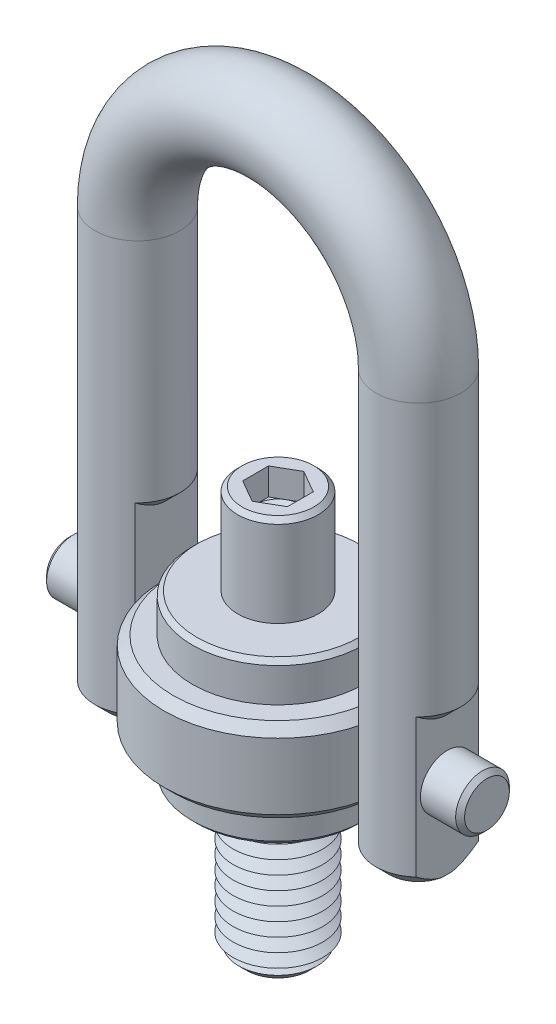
ISO-10303-21;
HEADER;
FILE_DESCRIPTION(('STEP AP214'),'2;1');
FILE_NAME('part.step','',(''),(''),'','','');
FILE_SCHEMA(('AUTOMOTIVE_DESIGN { 1 0 10303 214 1 1 1 1 }'));
ENDSEC;
DATA;
#1=APPLICATION_CONTEXT('core data for automotive mechanical design processes');
#2=APPLICATION_PROTOCOL_DEFINITION('international standard','automotive_design',2000,#1);
#3=PRODUCT_CONTEXT('',#1,'mechanical');
#4=PRODUCT('Part','Part','',(#3));
#5=PRODUCT_RELATED_PRODUCT_CATEGORY('part','',(#4));
#6=PRODUCT_DEFINITION_FORMATION('','',#4);
#7=PRODUCT_DEFINITION_CONTEXT('part definition',#1,'design');
#8=PRODUCT_DEFINITION('design','',#6,#7);
#9=PRODUCT_DEFINITION_SHAPE('','',#8);
#10=(LENGTH_UNIT() NAMED_UNIT(*) SI_UNIT(.MILLI.,.METRE.));
#11=(NAMED_UNIT(*) PLANE_ANGLE_UNIT() SI_UNIT($,.RADIAN.));
#12=(NAMED_UNIT(*) SI_UNIT($,.STERADIAN.) SOLID_ANGLE_UNIT());
#13=UNCERTAINTY_MEASURE_WITH_UNIT(LENGTH_MEASURE(1.E-05),#10,'distance_accuracy_value','');
#14=(GEOMETRIC_REPRESENTATION_CONTEXT(3) GLOBAL_UNCERTAINTY_ASSIGNED_CONTEXT((#13)) GLOBAL_UNIT_ASSIGNED_CONTEXT((#10,
#11,#12)) REPRESENTATION_CONTEXT('',''));
#15=CARTESIAN_POINT('',(0.,0.,0.));
#16=DIRECTION('',(0.,0.,1.));
#17=DIRECTION('',(1.,0.,0.));
#18=AXIS2_PLACEMENT_3D('',#15,#16,#17);
#19=CARTESIAN_POINT('',(23.35,0.,0.));
#20=DIRECTION('',(-1.,0.,0.));
#21=DIRECTION('',(0.,0.,1.));
#22=AXIS2_PLACEMENT_3D('',#19,#20,#21);
#23=CYLINDRICAL_SURFACE('',#22,3.);
#24=CARTESIAN_POINT('',(-22.85,0.,0.));
#25=DIRECTION('',(1.,0.,0.));
#26=DIRECTION('',(0.,0.,-1.));
#27=AXIS2_PLACEMENT_3D('',#24,#25,#26);
#28=CIRCLE('',#27,3.);
#29=CARTESIAN_POINT('',(-22.85,0.,-3.));
#30=VERTEX_POINT('',#29);
#31=EDGE_CURVE('P0_E25',#30,#30,#28,.T.);
#32=ORIENTED_EDGE('',*,*,#31,.T.);
#33=EDGE_LOOP('',(#32));
#34=FACE_BOUND('',#33,.T.);
#35=CARTESIAN_POINT('',(22.85,0.,0.));
#36=DIRECTION('',(1.,0.,0.));
#37=DIRECTION('',(0.,0.,-1.));
#38=AXIS2_PLACEMENT_3D('',#35,#36,#37);
#39=CIRCLE('',#38,3.);
#40=CARTESIAN_POINT('',(22.85,0.,-3.));
#41=VERTEX_POINT('',#40);
#42=EDGE_CURVE('P0_E29',#41,#41,#39,.F.);
#43=ORIENTED_EDGE('',*,*,#42,.T.);
#44=EDGE_LOOP('',(#43));
#45=FACE_BOUND('',#44,.T.);
#46=ADVANCED_FACE('P0_F14',(#34,#45),#23,.T.);
#47=CARTESIAN_POINT('',(23.35,0.,0.));
#48=DIRECTION('',(1.,0.,0.));
#49=DIRECTION('',(0.,0.,-1.));
#50=AXIS2_PLACEMENT_3D('',#47,#48,#49);
#51=PLANE('',#50);
#52=CARTESIAN_POINT('',(23.35,0.,0.));
#53=DIRECTION('',(1.,0.,0.));
#54=DIRECTION('',(0.,0.,-1.));
#55=AXIS2_PLACEMENT_3D('',#52,#53,#54);
#56=CIRCLE('',#55,2.5);
#57=CARTESIAN_POINT('',(23.35,0.,-2.5));
#58=VERTEX_POINT('',#57);
#59=EDGE_CURVE('P0_E10',#58,#58,#56,.T.);
#60=ORIENTED_EDGE('',*,*,#59,.T.);
#61=EDGE_LOOP('',(#60));
#62=FACE_BOUND('',#61,.T.);
#63=ADVANCED_FACE('P0_F46',(#62),#51,.T.);
#64=CARTESIAN_POINT('',(-23.35,0.,0.));
#65=DIRECTION('',(1.,0.,0.));
#66=DIRECTION('',(0.,0.,-1.));
#67=AXIS2_PLACEMENT_3D('',#64,#65,#66);
#68=PLANE('',#67);
#69=CARTESIAN_POINT('',(-23.35,0.,0.));
#70=DIRECTION('',(1.,0.,0.));
#71=DIRECTION('',(0.,0.,-1.));
#72=AXIS2_PLACEMENT_3D('',#69,#70,#71);
#73=CIRCLE('',#72,2.49999999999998);
#74=CARTESIAN_POINT('',(-23.35,0.,-2.49999999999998));
#75=VERTEX_POINT('',#74);
#76=EDGE_CURVE('P0_E21',#75,#75,#73,.F.);
#77=ORIENTED_EDGE('',*,*,#76,.T.);
#78=EDGE_LOOP('',(#77));
#79=FACE_BOUND('',#78,.T.);
#80=ADVANCED_FACE('P0_F43',(#79),#68,.F.);
#81=CARTESIAN_POINT('',(-22.85,0.,0.));
#82=DIRECTION('',(1.,0.,0.));
#83=DIRECTION('',(0.,0.,-1.));
#84=AXIS2_PLACEMENT_3D('',#81,#82,#83);
#85=CONICAL_SURFACE('',#84,3.,0.785398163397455);
#86=ORIENTED_EDGE('',*,*,#76,.F.);
#87=EDGE_LOOP('',(#86));
#88=FACE_BOUND('',#87,.T.);
#89=ORIENTED_EDGE('',*,*,#31,.F.);
#90=EDGE_LOOP('',(#89));
#91=FACE_BOUND('',#90,.T.);
#92=ADVANCED_FACE('P0_F38',(#88,#91),#85,.T.);
#93=CARTESIAN_POINT('',(23.35,0.,0.));
#94=DIRECTION('',(-1.,0.,0.));
#95=DIRECTION('',(0.,0.,1.));
#96=AXIS2_PLACEMENT_3D('',#93,#94,#95);
#97=CONICAL_SURFACE('',#96,2.5,0.785398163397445);
#98=ORIENTED_EDGE('',*,*,#42,.F.);
#99=EDGE_LOOP('',(#98));
#100=FACE_BOUND('',#99,.T.);
#101=ORIENTED_EDGE('',*,*,#59,.F.);
#102=EDGE_LOOP('',(#101));
#103=FACE_BOUND('',#102,.T.);
#104=ADVANCED_FACE('P0_F16',(#100,#103),#97,.T.);
#105=CLOSED_SHELL('',(#46,#63,#80,#92,#104));
#106=MANIFOLD_SOLID_BREP('P0_B1',#105);
#107=CARTESIAN_POINT('',(15.7,-8.99999999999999,0.));
#108=DIRECTION('',(0.,-1.,0.));
#109=DIRECTION('',(0.,0.,1.));
#110=AXIS2_PLACEMENT_3D('',#107,#108,#109);
#111=PLANE('',#110);
#112=DIRECTION('',(0.,0.,-1.));
#113=VECTOR('',#112,1.);
#114=CARTESIAN_POINT('',(12.4886918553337,-9.,3.5));
#115=LINE('',#114,#113);
#116=CARTESIAN_POINT('',(12.4886918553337,-9.,0.499999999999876));
#117=VERTEX_POINT('',#116);
#118=CARTESIAN_POINT('',(12.4886918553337,-9.,-0.500000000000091));
#119=VERTEX_POINT('',#118);
#120=EDGE_CURVE('P1_E132',#117,#119,#115,.T.);
#121=ORIENTED_EDGE('',*,*,#120,.T.);
#122=CARTESIAN_POINT('',(15.7,-8.99999999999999,0.));
#123=DIRECTION('',(0.,-1.,0.));
#124=DIRECTION('',(0.,0.,-1.));
#125=AXIS2_PLACEMENT_3D('',#122,#123,#124);
#126=CIRCLE('',#125,3.25000000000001);
#127=CARTESIAN_POINT('',(18.9113081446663,-9.,-0.500000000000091));
#128=VERTEX_POINT('',#127);
#129=EDGE_CURVE('P1_E192',#119,#128,#126,.T.);
#130=ORIENTED_EDGE('',*,*,#129,.T.);
#131=DIRECTION('',(0.,0.,1.));
#132=VECTOR('',#131,1.);
#133=CARTESIAN_POINT('',(18.9113081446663,-9.,3.5));
#134=LINE('',#133,#132);
#135=CARTESIAN_POINT('',(18.9113081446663,-9.,0.49999999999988));
#136=VERTEX_POINT('',#135);
#137=EDGE_CURVE('P1_E315',#128,#136,#134,.T.);
#138=ORIENTED_EDGE('',*,*,#137,.T.);
#139=CARTESIAN_POINT('',(15.7,-8.99999999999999,0.));
#140=DIRECTION('',(0.,-1.,0.));
#141=DIRECTION('',(0.,0.,-1.));
#142=AXIS2_PLACEMENT_3D('',#139,#140,#141);
#143=CIRCLE('',#142,3.24999999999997);
#144=CARTESIAN_POINT('',(15.7,-8.99999999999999,3.24999999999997));
#145=VERTEX_POINT('',#144);
#146=EDGE_CURVE('P1_E370',#136,#145,#143,.T.);
#147=ORIENTED_EDGE('',*,*,#146,.T.);
#148=CARTESIAN_POINT('',(15.7,-8.99999999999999,0.));
#149=DIRECTION('',(0.,-1.,0.));
#150=DIRECTION('',(0.,0.,-1.));
#151=AXIS2_PLACEMENT_3D('',#148,#149,#150);
#152=CIRCLE('',#151,3.24999999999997);
#153=EDGE_CURVE('P1_E369',#145,#117,#152,.T.);
#154=ORIENTED_EDGE('',*,*,#153,.T.);
#155=EDGE_LOOP('',(#121,#130,#138,#147,#154));
#156=FACE_BOUND('',#155,.T.);
#157=ADVANCED_FACE('P1_F16',(#156),#111,.T.);
#158=CARTESIAN_POINT('',(15.7,38.35,0.));
#159=DIRECTION('',(0.,-1.,0.));
#160=DIRECTION('',(0.,0.,-1.));
#161=AXIS2_PLACEMENT_3D('',#158,#159,#160);
#162=CYLINDRICAL_SURFACE('',#161,4.75);
#163=CARTESIAN_POINT('',(15.7,38.35,0.));
#164=DIRECTION('',(0.,-1.,0.));
#165=DIRECTION('',(0.,0.,1.));
#166=AXIS2_PLACEMENT_3D('',#163,#164,#165);
#167=CIRCLE('',#166,4.75);
#168=CARTESIAN_POINT('',(20.45,38.35,0.));
#169=VERTEX_POINT('',#168);
#170=EDGE_CURVE('P1_E143',#169,#169,#167,.T.);
#171=ORIENTED_EDGE('',*,*,#170,.T.);
#172=EDGE_LOOP('',(#171));
#173=FACE_BOUND('',#172,.T.);
#174=DIRECTION('',(0.,-1.,0.));
#175=VECTOR('',#174,1.);
#176=CARTESIAN_POINT('',(18.9113081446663,6.,-3.5));
#177=LINE('',#176,#175);
#178=CARTESIAN_POINT('',(18.9113081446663,8.00000000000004,-3.5));
#179=VERTEX_POINT('',#178);
#180=CARTESIAN_POINT('',(18.9113081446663,-7.5,-3.5));
#181=VERTEX_POINT('',#180);
#182=EDGE_CURVE('P1_E328',#179,#181,#177,.T.);
#183=ORIENTED_EDGE('',*,*,#182,.T.);
#184=CARTESIAN_POINT('',(15.7,-7.5,0.));
#185=DIRECTION('',(0.,-1.,0.));
#186=DIRECTION('',(0.,0.,-1.));
#187=AXIS2_PLACEMENT_3D('',#184,#185,#186);
#188=CIRCLE('',#187,4.75);
#189=CARTESIAN_POINT('',(12.4886918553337,-7.5,-3.5));
#190=VERTEX_POINT('',#189);
#191=EDGE_CURVE('P1_E128',#181,#190,#188,.F.);
#192=ORIENTED_EDGE('',*,*,#191,.T.);
#193=DIRECTION('',(0.,-1.,0.));
#194=VECTOR('',#193,1.);
#195=CARTESIAN_POINT('',(12.4886918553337,11.,-3.5));
#196=LINE('',#195,#194);
#197=CARTESIAN_POINT('',(12.4886918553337,13.,-3.5));
#198=VERTEX_POINT('',#197);
#199=EDGE_CURVE('P1_E120',#198,#190,#196,.T.);
#200=ORIENTED_EDGE('',*,*,#199,.F.);
#201=CARTESIAN_POINT('',(15.7,13.,0.));
#202=DIRECTION('',(0.,-1.,0.));
#203=DIRECTION('',(0.,0.,-1.));
#204=AXIS2_PLACEMENT_3D('',#201,#202,#203);
#205=CIRCLE('',#204,4.75);
#206=CARTESIAN_POINT('',(12.4886918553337,13.,3.5));
#207=VERTEX_POINT('',#206);
#208=EDGE_CURVE('P1_E126',#198,#207,#205,.F.);
#209=ORIENTED_EDGE('',*,*,#208,.T.);
#210=DIRECTION('',(0.,-1.,0.));
#211=VECTOR('',#210,1.);
#212=CARTESIAN_POINT('',(12.4886918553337,11.,3.5));
#213=LINE('',#212,#211);
#214=CARTESIAN_POINT('',(12.4886918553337,-7.49999999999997,3.5));
#215=VERTEX_POINT('',#214);
#216=EDGE_CURVE('P1_E131',#207,#215,#213,.T.);
#217=ORIENTED_EDGE('',*,*,#216,.T.);
#218=CARTESIAN_POINT('',(15.7,-7.49999999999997,0.));
#219=DIRECTION('',(0.,-1.,0.));
#220=DIRECTION('',(0.,0.,-1.));
#221=AXIS2_PLACEMENT_3D('',#218,#219,#220);
#222=CIRCLE('',#221,4.75);
#223=CARTESIAN_POINT('',(15.7,-7.49999999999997,4.75));
#224=VERTEX_POINT('',#223);
#225=EDGE_CURVE('P1_E530',#215,#224,#222,.F.);
#226=ORIENTED_EDGE('',*,*,#225,.T.);
#227=CARTESIAN_POINT('',(15.7,-7.49999999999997,0.));
#228=DIRECTION('',(0.,-1.,0.));
#229=DIRECTION('',(0.,0.,-1.));
#230=AXIS2_PLACEMENT_3D('',#227,#228,#229);
#231=CIRCLE('',#230,4.75);
#232=CARTESIAN_POINT('',(18.9113081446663,-7.49999999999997,3.5));
#233=VERTEX_POINT('',#232);
#234=EDGE_CURVE('P1_E528',#224,#233,#231,.F.);
#235=ORIENTED_EDGE('',*,*,#234,.T.);
#236=DIRECTION('',(0.,-1.,0.));
#237=VECTOR('',#236,1.);
#238=CARTESIAN_POINT('',(18.9113081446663,6.,3.5));
#239=LINE('',#238,#237);
#240=CARTESIAN_POINT('',(18.9113081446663,8.00000000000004,3.5));
#241=VERTEX_POINT('',#240);
#242=EDGE_CURVE('P1_E327',#241,#233,#239,.T.);
#243=ORIENTED_EDGE('',*,*,#242,.F.);
#244=CARTESIAN_POINT('',(15.7,8.00000000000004,0.));
#245=DIRECTION('',(0.,-1.,0.));
#246=DIRECTION('',(0.,0.,-1.));
#247=AXIS2_PLACEMENT_3D('',#244,#245,#246);
#248=CIRCLE('',#247,4.75);
#249=EDGE_CURVE('P1_E142',#241,#179,#248,.F.);
#250=ORIENTED_EDGE('',*,*,#249,.T.);
#251=EDGE_LOOP('',(#183,#192,#200,#209,#217,#226,#235,#243,#250));
#252=FACE_BOUND('',#251,.T.);
#253=ADVANCED_FACE('P1_F123',(#173,#252),#162,.T.);
#254=CARTESIAN_POINT('',(-15.7,-9.,0.));
#255=DIRECTION('',(0.,1.,0.));
#256=DIRECTION('',(0.,0.,1.));
#257=AXIS2_PLACEMENT_3D('',#254,#255,#256);
#258=PLANE('',#257);
#259=DIRECTION('',(0.,0.,1.));
#260=VECTOR('',#259,1.);
#261=CARTESIAN_POINT('',(-18.9113081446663,-9.,3.5));
#262=LINE('',#261,#260);
#263=CARTESIAN_POINT('',(-18.9113081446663,-9.,-0.499999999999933));
#264=VERTEX_POINT('',#263);
#265=CARTESIAN_POINT('',(-18.9113081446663,-9.,0.500000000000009));
#266=VERTEX_POINT('',#265);
#267=EDGE_CURVE('P1_E334',#264,#266,#262,.T.);
#268=ORIENTED_EDGE('',*,*,#267,.F.);
#269=CARTESIAN_POINT('',(-15.7,-9.,0.));
#270=DIRECTION('',(0.,1.,0.));
#271=DIRECTION('',(0.,0.,1.));
#272=AXIS2_PLACEMENT_3D('',#269,#270,#271);
#273=CIRCLE('',#272,3.24999999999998);
#274=CARTESIAN_POINT('',(-12.4886918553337,-9.,-0.499999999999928));
#275=VERTEX_POINT('',#274);
#276=EDGE_CURVE('P1_E40',#264,#275,#273,.F.);
#277=ORIENTED_EDGE('',*,*,#276,.T.);
#278=DIRECTION('',(0.,0.,-1.));
#279=VECTOR('',#278,1.);
#280=CARTESIAN_POINT('',(-12.4886918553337,-9.,3.5));
#281=LINE('',#280,#279);
#282=CARTESIAN_POINT('',(-12.4886918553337,-9.,0.500000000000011));
#283=VERTEX_POINT('',#282);
#284=EDGE_CURVE('P1_E303',#283,#275,#281,.T.);
#285=ORIENTED_EDGE('',*,*,#284,.F.);
#286=CARTESIAN_POINT('',(-15.7,-9.,0.));
#287=DIRECTION('',(0.,1.,0.));
#288=DIRECTION('',(0.,0.,1.));
#289=AXIS2_PLACEMENT_3D('',#286,#287,#288);
#290=CIRCLE('',#289,3.24999999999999);
#291=CARTESIAN_POINT('',(-15.7,-9.,3.24999999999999));
#292=VERTEX_POINT('',#291);
#293=EDGE_CURVE('P1_E34',#283,#292,#290,.F.);
#294=ORIENTED_EDGE('',*,*,#293,.T.);
#295=CARTESIAN_POINT('',(-15.7,-9.,0.));
#296=DIRECTION('',(0.,1.,0.));
#297=DIRECTION('',(0.,0.,1.));
#298=AXIS2_PLACEMENT_3D('',#295,#296,#297);
#299=CIRCLE('',#298,3.24999999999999);
#300=EDGE_CURVE('P1_E298',#292,#266,#299,.F.);
#301=ORIENTED_EDGE('',*,*,#300,.T.);
#302=EDGE_LOOP('',(#268,#277,#285,#294,#301));
#303=FACE_BOUND('',#302,.T.);
#304=ADVANCED_FACE('P1_F239',(#303),#258,.F.);
#305=CARTESIAN_POINT('',(-15.7,-9.,0.));
#306=DIRECTION('',(0.,1.,0.));
#307=DIRECTION('',(0.,0.,1.));
#308=AXIS2_PLACEMENT_3D('',#305,#306,#307);
#309=CYLINDRICAL_SURFACE('',#308,4.75);
#310=DIRECTION('',(0.,-1.,0.));
#311=VECTOR('',#310,1.);
#312=CARTESIAN_POINT('',(-12.4886918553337,11.,-3.5));
#313=LINE('',#312,#311);
#314=CARTESIAN_POINT('',(-12.4886918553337,13.,-3.5));
#315=VERTEX_POINT('',#314);
#316=CARTESIAN_POINT('',(-12.4886918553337,-7.49999999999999,-3.5));
#317=VERTEX_POINT('',#316);
#318=EDGE_CURVE('P1_E340',#315,#317,#313,.T.);
#319=ORIENTED_EDGE('',*,*,#318,.T.);
#320=CARTESIAN_POINT('',(-15.7,-7.49999999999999,0.));
#321=DIRECTION('',(0.,1.,0.));
#322=DIRECTION('',(0.,0.,1.));
#323=AXIS2_PLACEMENT_3D('',#320,#321,#322);
#324=CIRCLE('',#323,4.75);
#325=CARTESIAN_POINT('',(-18.9113081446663,-7.49999999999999,-3.5));
#326=VERTEX_POINT('',#325);
#327=EDGE_CURVE('P1_E287',#317,#326,#324,.T.);
#328=ORIENTED_EDGE('',*,*,#327,.T.);
#329=DIRECTION('',(0.,-1.,0.));
#330=VECTOR('',#329,1.);
#331=CARTESIAN_POINT('',(-18.9113081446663,6.,-3.5));
#332=LINE('',#331,#330);
#333=CARTESIAN_POINT('',(-18.9113081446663,8.00000000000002,-3.5));
#334=VERTEX_POINT('',#333);
#335=EDGE_CURVE('P1_E337',#334,#326,#332,.T.);
#336=ORIENTED_EDGE('',*,*,#335,.F.);
#337=CARTESIAN_POINT('',(-15.7,8.00000000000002,0.));
#338=DIRECTION('',(0.,-1.,0.));
#339=DIRECTION('',(0.,0.,-1.));
#340=AXIS2_PLACEMENT_3D('',#337,#338,#339);
#341=CIRCLE('',#340,4.75);
#342=CARTESIAN_POINT('',(-18.9113081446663,8.00000000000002,3.5));
#343=VERTEX_POINT('',#342);
#344=EDGE_CURVE('P1_E146',#334,#343,#341,.F.);
#345=ORIENTED_EDGE('',*,*,#344,.T.);
#346=DIRECTION('',(0.,-1.,0.));
#347=VECTOR('',#346,1.);
#348=CARTESIAN_POINT('',(-18.9113081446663,6.,3.5));
#349=LINE('',#348,#347);
#350=CARTESIAN_POINT('',(-18.9113081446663,-7.50000000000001,3.5));
#351=VERTEX_POINT('',#350);
#352=EDGE_CURVE('P1_E308',#343,#351,#349,.T.);
#353=ORIENTED_EDGE('',*,*,#352,.T.);
#354=CARTESIAN_POINT('',(-15.7,-7.50000000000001,0.));
#355=DIRECTION('',(0.,1.,0.));
#356=DIRECTION('',(0.,0.,1.));
#357=AXIS2_PLACEMENT_3D('',#354,#355,#356);
#358=CIRCLE('',#357,4.75);
#359=CARTESIAN_POINT('',(-15.7,-7.50000000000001,4.75));
#360=VERTEX_POINT('',#359);
#361=EDGE_CURVE('P1_E284',#351,#360,#358,.T.);
#362=ORIENTED_EDGE('',*,*,#361,.T.);
#363=CARTESIAN_POINT('',(-15.7,-7.50000000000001,0.));
#364=DIRECTION('',(0.,1.,0.));
#365=DIRECTION('',(0.,0.,1.));
#366=AXIS2_PLACEMENT_3D('',#363,#364,#365);
#367=CIRCLE('',#366,4.75);
#368=CARTESIAN_POINT('',(-12.4886918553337,-7.50000000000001,3.5));
#369=VERTEX_POINT('',#368);
#370=EDGE_CURVE('P1_E277',#360,#369,#367,.T.);
#371=ORIENTED_EDGE('',*,*,#370,.T.);
#372=DIRECTION('',(0.,-1.,0.));
#373=VECTOR('',#372,1.);
#374=CARTESIAN_POINT('',(-12.4886918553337,11.,3.5));
#375=LINE('',#374,#373);
#376=CARTESIAN_POINT('',(-12.4886918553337,13.,3.5));
#377=VERTEX_POINT('',#376);
#378=EDGE_CURVE('P1_E305',#377,#369,#375,.T.);
#379=ORIENTED_EDGE('',*,*,#378,.F.);
#380=CARTESIAN_POINT('',(-15.7,13.,0.));
#381=DIRECTION('',(0.,-1.,0.));
#382=DIRECTION('',(0.,0.,-1.));
#383=AXIS2_PLACEMENT_3D('',#380,#381,#382);
#384=CIRCLE('',#383,4.75);
#385=EDGE_CURVE('P1_E155',#377,#315,#384,.F.);
#386=ORIENTED_EDGE('',*,*,#385,.T.);
#387=EDGE_LOOP('',(#319,#328,#336,#345,#353,#362,#371,#379,#386));
#388=FACE_BOUND('',#387,.T.);
#389=CARTESIAN_POINT('',(-15.7,38.35,0.));
#390=DIRECTION('',(0.,1.,0.));
#391=DIRECTION('',(0.,0.,1.));
#392=AXIS2_PLACEMENT_3D('',#389,#390,#391);
#393=CIRCLE('',#392,4.75);
#394=CARTESIAN_POINT('',(-20.4500000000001,38.35,0.));
#395=VERTEX_POINT('',#394);
#396=EDGE_CURVE('P1_E149',#395,#395,#393,.T.);
#397=ORIENTED_EDGE('',*,*,#396,.F.);
#398=EDGE_LOOP('',(#397));
#399=FACE_BOUND('',#398,.T.);
#400=ADVANCED_FACE('P1_F241',(#388,#399),#309,.T.);
#401=CARTESIAN_POINT('',(0.,38.35,0.));
#402=DIRECTION('',(0.,0.,-1.));
#403=DIRECTION('',(-1.,0.,0.));
#404=AXIS2_PLACEMENT_3D('',#401,#402,#403);
#405=TOROIDAL_SURFACE('',#404,15.7,4.75);
#406=CARTESIAN_POINT('',(0.,38.35,0.));
#407=DIRECTION('',(0.,0.,-1.));
#408=DIRECTION('',(-1.,0.,0.));
#409=AXIS2_PLACEMENT_3D('',#406,#407,#408);
#410=CIRCLE('',#409,20.45);
#411=EDGE_CURVE('',#395,#169,#410,.T.);
#412=ORIENTED_EDGE('',*,*,#396,.T.);
#413=ORIENTED_EDGE('',*,*,#170,.F.);
#414=ORIENTED_EDGE('',*,*,#411,.T.);
#415=ORIENTED_EDGE('',*,*,#411,.F.);
#416=EDGE_LOOP('',(#412,#414,#413,#415));
#417=FACE_BOUND('',#416,.T.);
#418=ADVANCED_FACE('P1_F237',(#417),#405,.T.);
#419=CARTESIAN_POINT('',(-12.4886918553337,11.,3.5));
#420=DIRECTION('',(-1.,0.,0.));
#421=DIRECTION('',(0.,0.,1.));
#422=AXIS2_PLACEMENT_3D('',#419,#420,#421);
#423=PLANE('',#422);
#424=CARTESIAN_POINT('',(-12.4886918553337,0.,0.));
#425=DIRECTION('',(-1.,0.,0.));
#426=DIRECTION('',(0.,0.,1.));
#427=AXIS2_PLACEMENT_3D('',#424,#425,#426);
#428=CIRCLE('',#427,3.);
#429=CARTESIAN_POINT('',(-12.4886918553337,0.,3.));
#430=VERTEX_POINT('',#429);
#431=EDGE_CURVE('P1_E313',#430,#430,#428,.T.);
#432=ORIENTED_EDGE('',*,*,#431,.T.);
#433=EDGE_LOOP('',(#432));
#434=FACE_BOUND('',#433,.T.);
#435=ORIENTED_EDGE('',*,*,#284,.T.);
#436=CARTESIAN_POINT('',(-12.4886918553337,-9.,-0.49999999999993));
#437=CARTESIAN_POINT('',(-12.4886918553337,-8.96431755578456,-0.732126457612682));
#438=CARTESIAN_POINT('',(-12.4886918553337,-8.90504566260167,-0.958727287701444));
#439=CARTESIAN_POINT('',(-12.4886918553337,-8.79128625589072,-1.28868510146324));
#440=CARTESIAN_POINT('',(-12.4886918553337,-8.74955307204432,-1.39638648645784));
#441=CARTESIAN_POINT('',(-12.4886918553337,-8.65943719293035,-1.6090118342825));
#442=CARTESIAN_POINT('',(-12.4886918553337,-8.61104945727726,-1.71393361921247));
#443=CARTESIAN_POINT('',(-12.4886918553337,-8.48733927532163,-1.9651059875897));
#444=CARTESIAN_POINT('',(-12.4886918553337,-8.40929694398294,-2.11001256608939));
#445=CARTESIAN_POINT('',(-12.4886918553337,-8.24543028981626,-2.39535143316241));
#446=CARTESIAN_POINT('',(-12.4886918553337,-8.1596031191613,-2.53578205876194));
#447=CARTESIAN_POINT('',(-12.4886918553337,-7.98064576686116,-2.81542735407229));
#448=CARTESIAN_POINT('',(-12.4886918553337,-7.88741276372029,-2.95457585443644));
#449=CARTESIAN_POINT('',(-12.4886918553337,-7.74431893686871,-3.16086961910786));
#450=CARTESIAN_POINT('',(-12.4886918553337,-7.69611805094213,-3.22917849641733));
#451=CARTESIAN_POINT('',(-12.4886918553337,-7.59875110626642,-3.36509430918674));
#452=CARTESIAN_POINT('',(-12.4886918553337,-7.5495851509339,-3.43270131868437));
#453=CARTESIAN_POINT('',(-12.4886918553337,-7.49999999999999,-3.5));
#454=B_SPLINE_CURVE_WITH_KNOTS('',3,(#436,#437,#438,#439,#440,#441,#442,#443,#444,#445,#446,
#447,#448,#449,#450,#451,#452,#453),.UNSPECIFIED.,.F.,.F.,(4,2,2,2,2,2,2,2,4),(0.,
0.70078895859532,1.04698521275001,1.39344514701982,1.88684041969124,2.38041691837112,
2.882781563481,3.13358381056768,3.38435932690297),.UNSPECIFIED.);
#455=EDGE_CURVE('P1_E11',#275,#317,#454,.T.);
#456=ORIENTED_EDGE('',*,*,#455,.T.);
#457=ORIENTED_EDGE('',*,*,#318,.F.);
#458=CARTESIAN_POINT('',(-12.4886918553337,13.,-3.5));
#459=CARTESIAN_POINT('',(-12.4886918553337,12.93224068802,-3.40801477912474));
#460=CARTESIAN_POINT('',(-12.4886918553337,12.8652436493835,-3.31545721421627));
#461=CARTESIAN_POINT('',(-12.4886918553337,12.7331351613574,-3.12895874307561));
#462=CARTESIAN_POINT('',(-12.4886918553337,12.6680243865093,-3.03501735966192));
#463=CARTESIAN_POINT('',(-12.4886918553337,12.5394125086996,-2.84456235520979));
#464=CARTESIAN_POINT('',(-12.4886918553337,12.475936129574,-2.74803195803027));
#465=CARTESIAN_POINT('',(-12.4886918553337,12.3518749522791,-2.55314125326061));
#466=CARTESIAN_POINT('',(-12.4886918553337,12.2912898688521,-2.4547811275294));
#467=CARTESIAN_POINT('',(-12.4886918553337,12.1713582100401,-2.25199851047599));
#468=CARTESIAN_POINT('',(-12.4886918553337,12.1121551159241,-2.14749003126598));
#469=CARTESIAN_POINT('',(-12.4886918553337,11.998616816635,-1.93587248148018));
#470=CARTESIAN_POINT('',(-12.4886918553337,11.9442825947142,-1.8287628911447));
#471=CARTESIAN_POINT('',(-12.4886918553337,11.7908947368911,-1.50392697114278));
#472=CARTESIAN_POINT('',(-12.4886918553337,11.7007906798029,-1.28161787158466));
#473=CARTESIAN_POINT('',(-12.4886918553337,11.6006181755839,-0.960187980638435));
#474=CARTESIAN_POINT('',(-12.4886918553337,11.5747280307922,-0.865951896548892));
#475=CARTESIAN_POINT('',(-12.4886918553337,11.5303202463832,-0.675690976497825));
#476=CARTESIAN_POINT('',(-12.4886918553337,11.5118050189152,-0.579665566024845));
#477=CARTESIAN_POINT('',(-12.4886918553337,11.4831972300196,-0.387316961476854));
#478=CARTESIAN_POINT('',(-12.4886918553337,11.4730238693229,-0.291005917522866));
#479=CARTESIAN_POINT('',(-12.4886918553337,11.4613558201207,-0.0978925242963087));
#480=CARTESIAN_POINT('',(-12.4886918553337,11.4598568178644,-0.00109044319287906));
#481=CARTESIAN_POINT('',(-12.4886918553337,11.4649759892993,0.171134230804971));
#482=CARTESIAN_POINT('',(-12.4886918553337,11.4698941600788,0.246612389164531));
#483=CARTESIAN_POINT('',(-12.4886918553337,11.4848987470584,0.39708899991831));
#484=CARTESIAN_POINT('',(-12.4886918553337,11.4949879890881,0.472087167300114));
#485=CARTESIAN_POINT('',(-12.4886918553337,11.5270657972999,0.663201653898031));
#486=CARTESIAN_POINT('',(-12.4886918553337,11.5525551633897,0.778738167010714));
#487=CARTESIAN_POINT('',(-12.4886918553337,11.6137255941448,1.00712274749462));
#488=CARTESIAN_POINT('',(-12.4886918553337,11.6494159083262,1.1199682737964));
#489=CARTESIAN_POINT('',(-12.4886918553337,11.7294300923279,1.34346895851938));
#490=CARTESIAN_POINT('',(-12.4886918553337,11.7738164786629,1.45410145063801));
#491=CARTESIAN_POINT('',(-12.4886918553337,11.8693685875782,1.67241304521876));
#492=CARTESIAN_POINT('',(-12.4886918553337,11.9205369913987,1.78009095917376));
#493=CARTESIAN_POINT('',(-12.4886918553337,12.0473112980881,2.03039834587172));
#494=CARTESIAN_POINT('',(-12.4886918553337,12.1251510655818,2.17189014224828));
#495=CARTESIAN_POINT('',(-12.4886918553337,12.2880330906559,2.45071555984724));
#496=CARTESIAN_POINT('',(-12.4886918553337,12.3730795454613,2.58804669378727));
#497=CARTESIAN_POINT('',(-12.4886918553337,12.5464350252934,2.85605395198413));
#498=CARTESIAN_POINT('',(-12.4886918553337,12.6346202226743,2.98681063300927));
#499=CARTESIAN_POINT('',(-12.4886918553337,12.7697252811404,3.18081056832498));
#500=CARTESIAN_POINT('',(-12.4886918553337,12.8151953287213,3.24507258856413));
#501=CARTESIAN_POINT('',(-12.4886918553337,12.9069862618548,3.37298099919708));
#502=CARTESIAN_POINT('',(-12.4886918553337,12.9533070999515,3.43662742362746));
#503=CARTESIAN_POINT('',(-12.4886918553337,13.,3.5));
#504=B_SPLINE_CURVE_WITH_KNOTS('',3,(#458,#459,#460,#461,#462,#463,#464,#465,#466,#467,#468,
#469,#470,#471,#472,#473,#474,#475,#476,#477,#478,#479,#480,#481,#482,#483,#484,#485,#486,#487,
#488,#489,#490,#491,#492,#493,#494,#495,#496,#497,#498,#499,#500,#501,#502,#503),.UNSPECIFIED.,
.F.,.F.,(4,2,2,2,2,2,2,2,2,2,2,2,2,2,2,2,2,2,2,2,2,2,4),(0.,0.342752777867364,0.685626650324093,
1.03217450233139,1.37868809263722,1.73889082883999,2.09916614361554,2.81593528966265,
3.10888520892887,3.40193086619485,3.69210339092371,3.98213160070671,4.20886770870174,
4.43572785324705,4.79008595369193,5.14476638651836,5.50209695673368,5.85956921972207,
6.34373165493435,6.82817803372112,7.30122722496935,7.53738755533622,7.77353475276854),.UNSPECIFIED.);
#505=EDGE_CURVE('P1_E138',#315,#377,#504,.T.);
#506=ORIENTED_EDGE('',*,*,#505,.T.);
#507=ORIENTED_EDGE('',*,*,#378,.T.);
#508=CARTESIAN_POINT('',(-12.4886918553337,-7.50000000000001,3.5));
#509=CARTESIAN_POINT('',(-12.4886918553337,-7.57030863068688,3.40455050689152));
#510=CARTESIAN_POINT('',(-12.4886918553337,-7.63979934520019,3.30848560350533));
#511=CARTESIAN_POINT('',(-12.4886918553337,-7.77674009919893,3.11485120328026));
#512=CARTESIAN_POINT('',(-12.4886918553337,-7.84418923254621,3.01728106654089));
#513=CARTESIAN_POINT('',(-12.4886918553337,-7.97730741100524,2.81936359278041));
#514=CARTESIAN_POINT('',(-12.4886918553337,-8.0429487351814,2.71899751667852));
#515=CARTESIAN_POINT('',(-12.4886918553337,-8.17104078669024,2.51626462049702));
#516=CARTESIAN_POINT('',(-12.4886918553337,-8.23349196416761,2.41389808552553));
#517=CARTESIAN_POINT('',(-12.4886918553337,-8.3523192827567,2.21042807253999));
#518=CARTESIAN_POINT('',(-12.4886918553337,-8.40883129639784,2.10940492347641));
#519=CARTESIAN_POINT('',(-12.4886918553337,-8.51721793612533,1.90491073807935));
#520=CARTESIAN_POINT('',(-12.4886918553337,-8.5690915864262,1.80143919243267));
#521=CARTESIAN_POINT('',(-12.4886918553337,-8.71561212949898,1.48777751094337));
#522=CARTESIAN_POINT('',(-12.4886918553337,-8.80179560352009,1.27329531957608));
#523=CARTESIAN_POINT('',(-12.4886918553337,-8.88437945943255,1.00833190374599));
#524=CARTESIAN_POINT('',(-12.4886918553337,-8.89769655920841,0.962993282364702));
#525=CARTESIAN_POINT('',(-12.4886918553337,-8.92273118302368,0.871859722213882));
#526=CARTESIAN_POINT('',(-12.4886918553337,-8.93444830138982,0.826064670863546));
#527=CARTESIAN_POINT('',(-12.4886918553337,-8.95623469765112,0.733765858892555));
#528=CARTESIAN_POINT('',(-12.4886918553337,-8.96629265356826,0.687259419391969));
#529=CARTESIAN_POINT('',(-12.4886918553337,-8.98455961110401,0.593886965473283));
#530=CARTESIAN_POINT('',(-12.4886918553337,-8.99276867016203,0.54702096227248));
#531=CARTESIAN_POINT('',(-12.4886918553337,-9.,0.500000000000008));
#532=B_SPLINE_CURVE_WITH_KNOTS('',3,(#508,#509,#510,#511,#512,#513,#514,#515,#516,#517,#518,
#519,#520,#521,#522,#523,#524,#525,#526,#527,#528,#529,#530,#531),.UNSPECIFIED.,.F.,.F.,(4,2,2,
2,2,2,2,2,2,2,2,4),(0.,0.355658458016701,0.711472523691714,1.07119821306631,1.43087300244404,
1.77801189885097,2.12522365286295,2.81598705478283,2.95772912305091,3.09950706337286,
3.24221568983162,3.38491988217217),.UNSPECIFIED.);
#533=EDGE_CURVE('P1_E26',#369,#283,#532,.T.);
#534=ORIENTED_EDGE('',*,*,#533,.T.);
#535=EDGE_LOOP('',(#435,#456,#457,#506,#507,#534));
#536=FACE_BOUND('',#535,.T.);
#537=ADVANCED_FACE('P1_F232',(#434,#536),#423,.F.);
#538=CARTESIAN_POINT('',(-18.9113081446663,6.,3.5));
#539=DIRECTION('',(1.,0.,0.));
#540=DIRECTION('',(0.,0.,-1.));
#541=AXIS2_PLACEMENT_3D('',#538,#539,#540);
#542=PLANE('',#541);
#543=CARTESIAN_POINT('',(-18.9113081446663,0.,0.));
#544=DIRECTION('',(1.,0.,0.));
#545=DIRECTION('',(0.,0.,-1.));
#546=AXIS2_PLACEMENT_3D('',#543,#544,#545);
#547=CIRCLE('',#546,3.);
#548=CARTESIAN_POINT('',(-18.9113081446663,0.,-3.));
#549=VERTEX_POINT('',#548);
#550=EDGE_CURVE('P1_E321',#549,#549,#547,.F.);
#551=ORIENTED_EDGE('',*,*,#550,.F.);
#552=EDGE_LOOP('',(#551));
#553=FACE_BOUND('',#552,.T.);
#554=ORIENTED_EDGE('',*,*,#335,.T.);
#555=CARTESIAN_POINT('',(-18.9113081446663,-7.49999999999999,-3.5));
#556=CARTESIAN_POINT('',(-18.9113081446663,-7.57030863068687,-3.40455050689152));
#557=CARTESIAN_POINT('',(-18.9113081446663,-7.63979934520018,-3.30848560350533));
#558=CARTESIAN_POINT('',(-18.9113081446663,-7.77674009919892,-3.11485120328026));
#559=CARTESIAN_POINT('',(-18.9113081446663,-7.8441892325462,-3.01728106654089));
#560=CARTESIAN_POINT('',(-18.9113081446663,-7.97730741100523,-2.81936359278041));
#561=CARTESIAN_POINT('',(-18.9113081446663,-8.04294873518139,-2.71899751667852));
#562=CARTESIAN_POINT('',(-18.9113081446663,-8.17104078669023,-2.51626462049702));
#563=CARTESIAN_POINT('',(-18.9113081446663,-8.2334919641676,-2.41389808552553));
#564=CARTESIAN_POINT('',(-18.9113081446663,-8.35231928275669,-2.21042807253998));
#565=CARTESIAN_POINT('',(-18.9113081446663,-8.40883129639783,-2.10940492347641));
#566=CARTESIAN_POINT('',(-18.9113081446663,-8.51721793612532,-1.90491073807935));
#567=CARTESIAN_POINT('',(-18.9113081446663,-8.56909158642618,-1.80143919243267));
#568=CARTESIAN_POINT('',(-18.9113081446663,-8.71561212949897,-1.48777751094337));
#569=CARTESIAN_POINT('',(-18.9113081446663,-8.80179560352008,-1.27329531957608));
#570=CARTESIAN_POINT('',(-18.9113081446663,-8.88437945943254,-1.00833190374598));
#571=CARTESIAN_POINT('',(-18.9113081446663,-8.8976965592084,-0.96299328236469));
#572=CARTESIAN_POINT('',(-18.9113081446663,-8.92273118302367,-0.871859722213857));
#573=CARTESIAN_POINT('',(-18.9113081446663,-8.93444830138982,-0.826064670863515));
#574=CARTESIAN_POINT('',(-18.9113081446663,-8.95623469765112,-0.733765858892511));
#575=CARTESIAN_POINT('',(-18.9113081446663,-8.96629265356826,-0.687259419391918));
#576=CARTESIAN_POINT('',(-18.9113081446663,-8.98455961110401,-0.593886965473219));
#577=CARTESIAN_POINT('',(-18.9113081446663,-8.99276867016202,-0.547020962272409));
#578=CARTESIAN_POINT('',(-18.9113081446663,-9.,-0.49999999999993));
#579=B_SPLINE_CURVE_WITH_KNOTS('',3,(#555,#556,#557,#558,#559,#560,#561,#562,#563,#564,#565,
#566,#567,#568,#569,#570,#571,#572,#573,#574,#575,#576,#577,#578),.UNSPECIFIED.,.F.,.F.,(4,2,2,
2,2,2,2,2,2,2,2,4),(0.,0.355658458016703,0.711472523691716,1.07119821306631,1.43087300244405,
1.77801189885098,2.12522365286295,2.81598705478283,2.95772912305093,3.09950706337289,
3.24221568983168,3.38491988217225),.UNSPECIFIED.);
#580=EDGE_CURVE('P1_E216',#326,#264,#579,.T.);
#581=ORIENTED_EDGE('',*,*,#580,.T.);
#582=ORIENTED_EDGE('',*,*,#267,.T.);
#583=CARTESIAN_POINT('',(-18.9113081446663,-9.,0.500000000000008));
#584=CARTESIAN_POINT('',(-18.9113081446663,-8.96431755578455,0.732126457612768));
#585=CARTESIAN_POINT('',(-18.9113081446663,-8.90504566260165,0.958727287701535));
#586=CARTESIAN_POINT('',(-18.9113081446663,-8.7912862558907,1.28868510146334));
#587=CARTESIAN_POINT('',(-18.9113081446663,-8.74955307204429,1.39638648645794));
#588=CARTESIAN_POINT('',(-18.9113081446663,-8.65943719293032,1.60901183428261));
#589=CARTESIAN_POINT('',(-18.9113081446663,-8.61104945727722,1.71393361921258));
#590=CARTESIAN_POINT('',(-18.9113081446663,-8.48733927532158,1.9651059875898));
#591=CARTESIAN_POINT('',(-18.9113081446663,-8.4092969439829,2.11001256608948));
#592=CARTESIAN_POINT('',(-18.9113081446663,-8.24543028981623,2.39535143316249));
#593=CARTESIAN_POINT('',(-18.9113081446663,-8.15960311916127,2.53578205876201));
#594=CARTESIAN_POINT('',(-18.9113081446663,-7.98064576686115,2.81542735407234));
#595=CARTESIAN_POINT('',(-18.9113081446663,-7.88741276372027,2.95457585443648));
#596=CARTESIAN_POINT('',(-18.9113081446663,-7.74431893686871,3.16086961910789));
#597=CARTESIAN_POINT('',(-18.9113081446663,-7.69611805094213,3.22917849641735));
#598=CARTESIAN_POINT('',(-18.9113081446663,-7.59875110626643,3.36509430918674));
#599=CARTESIAN_POINT('',(-18.9113081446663,-7.54958515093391,3.43270131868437));
#600=CARTESIAN_POINT('',(-18.9113081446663,-7.50000000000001,3.5));
#601=B_SPLINE_CURVE_WITH_KNOTS('',3,(#583,#584,#585,#586,#587,#588,#589,#590,#591,#592,#593,
#594,#595,#596,#597,#598,#599,#600),.UNSPECIFIED.,.F.,.F.,(4,2,2,2,2,2,2,2,4),(0.,
0.700788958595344,1.04698521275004,1.39344514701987,1.88684041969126,2.38041691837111,
2.88278156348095,3.13358381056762,3.38435932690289),.UNSPECIFIED.);
#602=EDGE_CURVE('P1_E289',#266,#351,#601,.T.);
#603=ORIENTED_EDGE('',*,*,#602,.T.);
#604=ORIENTED_EDGE('',*,*,#352,.F.);
#605=CARTESIAN_POINT('',(-18.9113081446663,8.00000000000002,3.5));
#606=CARTESIAN_POINT('',(-18.9113081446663,7.93224068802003,3.40801477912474));
#607=CARTESIAN_POINT('',(-18.9113081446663,7.86524364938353,3.31545721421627));
#608=CARTESIAN_POINT('',(-18.9113081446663,7.73313516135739,3.12895874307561));
#609=CARTESIAN_POINT('',(-18.9113081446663,7.66802438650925,3.03501735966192));
#610=CARTESIAN_POINT('',(-18.9113081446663,7.53941250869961,2.84456235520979));
#611=CARTESIAN_POINT('',(-18.9113081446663,7.47593612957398,2.74803195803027));
#612=CARTESIAN_POINT('',(-18.9113081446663,7.35187495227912,2.55314125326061));
#613=CARTESIAN_POINT('',(-18.9113081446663,7.29128986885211,2.4547811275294));
#614=CARTESIAN_POINT('',(-18.9113081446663,7.17135821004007,2.25199851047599));
#615=CARTESIAN_POINT('',(-18.9113081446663,7.11215511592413,2.14749003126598));
#616=CARTESIAN_POINT('',(-18.9113081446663,6.99861681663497,1.93587248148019));
#617=CARTESIAN_POINT('',(-18.9113081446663,6.9442825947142,1.8287628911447));
#618=CARTESIAN_POINT('',(-18.9113081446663,6.79089473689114,1.50392697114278));
#619=CARTESIAN_POINT('',(-18.9113081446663,6.70079067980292,1.28161787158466));
#620=CARTESIAN_POINT('',(-18.9113081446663,6.60061817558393,0.960187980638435));
#621=CARTESIAN_POINT('',(-18.9113081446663,6.57472803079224,0.865951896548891));
#622=CARTESIAN_POINT('',(-18.9113081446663,6.53032024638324,0.675690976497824));
#623=CARTESIAN_POINT('',(-18.9113081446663,6.51180501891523,0.579665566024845));
#624=CARTESIAN_POINT('',(-18.9113081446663,6.48319723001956,0.387316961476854));
#625=CARTESIAN_POINT('',(-18.9113081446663,6.47302386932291,0.291005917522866));
#626=CARTESIAN_POINT('',(-18.9113081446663,6.46135582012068,0.0978925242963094));
#627=CARTESIAN_POINT('',(-18.9113081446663,6.45985681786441,0.00109044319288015));
#628=CARTESIAN_POINT('',(-18.9113081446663,6.4649759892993,-0.171134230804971));
#629=CARTESIAN_POINT('',(-18.9113081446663,6.46989416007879,-0.24661238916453));
#630=CARTESIAN_POINT('',(-18.9113081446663,6.48489874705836,-0.397088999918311));
#631=CARTESIAN_POINT('',(-18.9113081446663,6.49498798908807,-0.472087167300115));
#632=CARTESIAN_POINT('',(-18.9113081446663,6.52706579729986,-0.663201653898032));
#633=CARTESIAN_POINT('',(-18.9113081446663,6.55255516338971,-0.778738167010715));
#634=CARTESIAN_POINT('',(-18.9113081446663,6.61372559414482,-1.00712274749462));
#635=CARTESIAN_POINT('',(-18.9113081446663,6.6494159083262,-1.1199682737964));
#636=CARTESIAN_POINT('',(-18.9113081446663,6.72943009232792,-1.34346895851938));
#637=CARTESIAN_POINT('',(-18.9113081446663,6.7738164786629,-1.45410145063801));
#638=CARTESIAN_POINT('',(-18.9113081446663,6.86936858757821,-1.67241304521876));
#639=CARTESIAN_POINT('',(-18.9113081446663,6.9205369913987,-1.78009095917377));
#640=CARTESIAN_POINT('',(-18.9113081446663,7.04731129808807,-2.03039834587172));
#641=CARTESIAN_POINT('',(-18.9113081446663,7.12515106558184,-2.17189014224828));
#642=CARTESIAN_POINT('',(-18.9113081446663,7.28803309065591,-2.45071555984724));
#643=CARTESIAN_POINT('',(-18.9113081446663,7.37307954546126,-2.58804669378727));
#644=CARTESIAN_POINT('',(-18.9113081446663,7.5464350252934,-2.85605395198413));
#645=CARTESIAN_POINT('',(-18.9113081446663,7.63462022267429,-2.98681063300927));
#646=CARTESIAN_POINT('',(-18.9113081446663,7.76972528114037,-3.18081056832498));
#647=CARTESIAN_POINT('',(-18.9113081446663,7.81519532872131,-3.24507258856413));
#648=CARTESIAN_POINT('',(-18.9113081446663,7.90698626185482,-3.37298099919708));
#649=CARTESIAN_POINT('',(-18.9113081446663,7.95330709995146,-3.43662742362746));
#650=CARTESIAN_POINT('',(-18.9113081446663,8.00000000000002,-3.5));
#651=B_SPLINE_CURVE_WITH_KNOTS('',3,(#605,#606,#607,#608,#609,#610,#611,#612,#613,#614,#615,
#616,#617,#618,#619,#620,#621,#622,#623,#624,#625,#626,#627,#628,#629,#630,#631,#632,#633,#634,
#635,#636,#637,#638,#639,#640,#641,#642,#643,#644,#645,#646,#647,#648,#649,#650),.UNSPECIFIED.,
.F.,.F.,(4,2,2,2,2,2,2,2,2,2,2,2,2,2,2,2,2,2,2,2,2,2,4),(0.,0.342752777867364,0.685626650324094,
1.03217450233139,1.37868809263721,1.73889082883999,2.09916614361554,2.81593528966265,
3.10888520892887,3.40193086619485,3.69210339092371,3.98213160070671,4.20886770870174,
4.43572785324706,4.79008595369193,5.14476638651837,5.50209695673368,5.85956921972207,
6.34373165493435,6.82817803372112,7.30122722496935,7.53738755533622,7.77353475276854),.UNSPECIFIED.);
#652=EDGE_CURVE('P1_E251',#343,#334,#651,.T.);
#653=ORIENTED_EDGE('',*,*,#652,.T.);
#654=EDGE_LOOP('',(#554,#581,#582,#603,#604,#653));
#655=FACE_BOUND('',#654,.T.);
#656=ADVANCED_FACE('P1_F236',(#553,#655),#542,.F.);
#657=CARTESIAN_POINT('',(12.4886918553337,11.,3.5));
#658=DIRECTION('',(-1.,0.,0.));
#659=DIRECTION('',(0.,0.,1.));
#660=AXIS2_PLACEMENT_3D('',#657,#658,#659);
#661=PLANE('',#660);
#662=CARTESIAN_POINT('',(12.4886918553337,0.,0.));
#663=DIRECTION('',(-1.,0.,0.));
#664=DIRECTION('',(0.,0.,1.));
#665=AXIS2_PLACEMENT_3D('',#662,#663,#664);
#666=CIRCLE('',#665,3.);
#667=CARTESIAN_POINT('',(12.4886918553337,0.,3.));
#668=VERTEX_POINT('',#667);
#669=EDGE_CURVE('P1_E317',#668,#668,#666,.T.);
#670=ORIENTED_EDGE('',*,*,#669,.F.);
#671=EDGE_LOOP('',(#670));
#672=FACE_BOUND('',#671,.T.);
#673=ORIENTED_EDGE('',*,*,#199,.T.);
#674=CARTESIAN_POINT('',(12.4886918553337,-7.5,-3.5));
#675=CARTESIAN_POINT('',(12.4886918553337,-7.57030863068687,-3.40455050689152));
#676=CARTESIAN_POINT('',(12.4886918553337,-7.63979934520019,-3.30848560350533));
#677=CARTESIAN_POINT('',(12.4886918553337,-7.77674009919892,-3.11485120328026));
#678=CARTESIAN_POINT('',(12.4886918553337,-7.84418923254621,-3.01728106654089));
#679=CARTESIAN_POINT('',(12.4886918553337,-7.97730741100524,-2.81936359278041));
#680=CARTESIAN_POINT('',(12.4886918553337,-8.0429487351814,-2.71899751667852));
#681=CARTESIAN_POINT('',(12.4886918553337,-8.17104078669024,-2.51626462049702));
#682=CARTESIAN_POINT('',(12.4886918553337,-8.23349196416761,-2.41389808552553));
#683=CARTESIAN_POINT('',(12.4886918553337,-8.3523192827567,-2.21042807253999));
#684=CARTESIAN_POINT('',(12.4886918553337,-8.40883129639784,-2.10940492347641));
#685=CARTESIAN_POINT('',(12.4886918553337,-8.51721793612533,-1.90491073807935));
#686=CARTESIAN_POINT('',(12.4886918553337,-8.56909158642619,-1.80143919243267));
#687=CARTESIAN_POINT('',(12.4886918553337,-8.71561212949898,-1.48777751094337));
#688=CARTESIAN_POINT('',(12.4886918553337,-8.8017956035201,-1.27329531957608));
#689=CARTESIAN_POINT('',(12.4886918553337,-8.88437945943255,-1.00833190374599));
#690=CARTESIAN_POINT('',(12.4886918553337,-8.89769655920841,-0.962993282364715));
#691=CARTESIAN_POINT('',(12.4886918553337,-8.92273118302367,-0.87185972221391));
#692=CARTESIAN_POINT('',(12.4886918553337,-8.93444830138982,-0.826064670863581));
#693=CARTESIAN_POINT('',(12.4886918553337,-8.95623469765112,-0.733765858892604));
#694=CARTESIAN_POINT('',(12.4886918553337,-8.96629265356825,-0.687259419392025));
#695=CARTESIAN_POINT('',(12.4886918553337,-8.98455961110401,-0.593886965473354));
#696=CARTESIAN_POINT('',(12.4886918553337,-8.99276867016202,-0.547020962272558));
#697=CARTESIAN_POINT('',(12.4886918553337,-8.99999999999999,-0.500000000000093));
#698=B_SPLINE_CURVE_WITH_KNOTS('',3,(#674,#675,#676,#677,#678,#679,#680,#681,#682,#683,#684,
#685,#686,#687,#688,#689,#690,#691,#692,#693,#694,#695,#696,#697),.UNSPECIFIED.,.F.,.F.,(4,2,2,
2,2,2,2,2,2,2,2,4),(0.,0.355658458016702,0.711472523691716,1.07119821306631,1.43087300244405,
1.77801189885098,2.12522365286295,2.81598705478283,2.95772912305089,3.09950706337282,
3.24221568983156,3.38491988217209),.UNSPECIFIED.);
#699=EDGE_CURVE('P1_E271',#190,#119,#698,.T.);
#700=ORIENTED_EDGE('',*,*,#699,.T.);
#701=ORIENTED_EDGE('',*,*,#120,.F.);
#702=CARTESIAN_POINT('',(12.4886918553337,-8.99999999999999,0.499999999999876));
#703=CARTESIAN_POINT('',(12.4886918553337,-8.96431755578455,0.732126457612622));
#704=CARTESIAN_POINT('',(12.4886918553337,-8.90504566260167,0.958727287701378));
#705=CARTESIAN_POINT('',(12.4886918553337,-8.79128625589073,1.28868510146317));
#706=CARTESIAN_POINT('',(12.4886918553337,-8.74955307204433,1.39638648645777));
#707=CARTESIAN_POINT('',(12.4886918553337,-8.65943719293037,1.60901183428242));
#708=CARTESIAN_POINT('',(12.4886918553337,-8.61104945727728,1.71393361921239));
#709=CARTESIAN_POINT('',(12.4886918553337,-8.48733927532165,1.96510598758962));
#710=CARTESIAN_POINT('',(12.4886918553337,-8.40929694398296,2.11001256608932));
#711=CARTESIAN_POINT('',(12.4886918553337,-8.24543028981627,2.39535143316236));
#712=CARTESIAN_POINT('',(12.4886918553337,-8.1596031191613,2.53578205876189));
#713=CARTESIAN_POINT('',(12.4886918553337,-7.98064576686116,2.81542735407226));
#714=CARTESIAN_POINT('',(12.4886918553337,-7.88741276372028,2.95457585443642));
#715=CARTESIAN_POINT('',(12.4886918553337,-7.7443189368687,3.16086961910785));
#716=CARTESIAN_POINT('',(12.4886918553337,-7.69611805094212,3.22917849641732));
#717=CARTESIAN_POINT('',(12.4886918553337,-7.5987511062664,3.36509430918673));
#718=CARTESIAN_POINT('',(12.4886918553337,-7.54958515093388,3.43270131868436));
#719=CARTESIAN_POINT('',(12.4886918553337,-7.49999999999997,3.5));
#720=B_SPLINE_CURVE_WITH_KNOTS('',3,(#702,#703,#704,#705,#706,#707,#708,#709,#710,#711,#712,
#713,#714,#715,#716,#717,#718,#719),.UNSPECIFIED.,.F.,.F.,(4,2,2,2,2,2,2,2,4),(0.,
0.7007889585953,1.04698521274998,1.39344514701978,1.88684041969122,2.38041691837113,
2.88278156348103,3.13358381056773,3.38435932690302),.UNSPECIFIED.);
#721=EDGE_CURVE('P1_E278',#117,#215,#720,.T.);
#722=ORIENTED_EDGE('',*,*,#721,.T.);
#723=ORIENTED_EDGE('',*,*,#216,.F.);
#724=CARTESIAN_POINT('',(12.4886918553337,13.,3.5));
#725=CARTESIAN_POINT('',(12.4886918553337,12.9313981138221,3.40686985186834));
#726=CARTESIAN_POINT('',(12.4886918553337,12.8635767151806,3.31315331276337));
#727=CARTESIAN_POINT('',(12.4886918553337,12.7298696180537,3.12429697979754));
#728=CARTESIAN_POINT('',(12.4886918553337,12.6639846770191,3.02915665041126));
#729=CARTESIAN_POINT('',(12.4886918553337,12.5338773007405,2.83623364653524));
#730=CARTESIAN_POINT('',(12.4886918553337,12.4696806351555,2.73843350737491));
#731=CARTESIAN_POINT('',(12.4886918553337,12.3442760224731,2.54094858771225));
#732=CARTESIAN_POINT('',(12.4886918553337,12.2830677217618,2.44126403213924));
#733=CARTESIAN_POINT('',(12.4886918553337,12.1634939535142,2.23824916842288));
#734=CARTESIAN_POINT('',(12.4886918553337,12.1051816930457,2.13488710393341));
#735=CARTESIAN_POINT('',(12.4886918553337,11.9933487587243,1.92561348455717));
#736=CARTESIAN_POINT('',(12.4886918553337,11.9398291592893,1.81970136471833));
#737=CARTESIAN_POINT('',(12.4886918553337,11.7887253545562,1.49855432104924));
#738=CARTESIAN_POINT('',(12.4886918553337,11.6999257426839,1.27881969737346));
#739=CARTESIAN_POINT('',(12.4886918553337,11.6167422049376,1.01193037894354));
#740=CARTESIAN_POINT('',(12.4886918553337,11.6044327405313,0.970224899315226));
#741=CARTESIAN_POINT('',(12.4886918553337,11.5811613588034,0.886430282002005));
#742=CARTESIAN_POINT('',(12.4886918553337,11.5701996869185,0.844341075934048));
#743=CARTESIAN_POINT('',(12.4886918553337,11.5394895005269,0.717599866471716));
#744=CARTESIAN_POINT('',(12.4886918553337,11.5218956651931,0.632410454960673));
#745=CARTESIAN_POINT('',(12.4886918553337,11.4941546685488,0.467111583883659));
#746=CARTESIAN_POINT('',(12.4886918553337,11.4835634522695,0.387076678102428));
#747=CARTESIAN_POINT('',(12.4886918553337,11.4682878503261,0.226425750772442));
#748=CARTESIAN_POINT('',(12.4886918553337,11.4636042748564,0.145809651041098));
#749=CARTESIAN_POINT('',(12.4886918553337,11.4603340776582,-0.0154871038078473));
#750=CARTESIAN_POINT('',(12.4886918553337,11.4617428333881,-0.0961676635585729));
#751=CARTESIAN_POINT('',(12.4886918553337,11.4705872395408,-0.257202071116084));
#752=CARTESIAN_POINT('',(12.4886918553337,11.4780238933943,-0.337555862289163));
#753=CARTESIAN_POINT('',(12.4886918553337,11.503079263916,-0.531836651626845));
#754=CARTESIAN_POINT('',(12.4886918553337,11.5236968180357,-0.645383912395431));
#755=CARTESIAN_POINT('',(12.4886918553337,11.5752931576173,-0.870092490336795));
#756=CARTESIAN_POINT('',(12.4886918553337,11.60627755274,-0.981252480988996));
#757=CARTESIAN_POINT('',(12.4886918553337,11.7127951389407,-1.3124390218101));
#758=CARTESIAN_POINT('',(12.4886918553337,11.8015853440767,-1.52819676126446));
#759=CARTESIAN_POINT('',(12.4886918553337,11.9772052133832,-1.89712353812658));
#760=CARTESIAN_POINT('',(12.4886918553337,12.0592323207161,-2.05272431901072));
#761=CARTESIAN_POINT('',(12.4886918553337,12.2325591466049,-2.35885297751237));
#762=CARTESIAN_POINT('',(12.4886918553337,12.3238670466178,-2.5093762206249));
#763=CARTESIAN_POINT('',(12.4886918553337,12.5103163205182,-2.80180294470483));
#764=CARTESIAN_POINT('',(12.4886918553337,12.6052668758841,-2.94382975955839));
#765=CARTESIAN_POINT('',(12.4886918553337,12.7510542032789,-3.1542869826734));
#766=CARTESIAN_POINT('',(12.4886918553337,12.8001523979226,-3.22393102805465));
#767=CARTESIAN_POINT('',(12.4886918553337,12.899355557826,-3.36249035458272));
#768=CARTESIAN_POINT('',(12.4886918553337,12.9494604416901,-3.43140569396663));
#769=CARTESIAN_POINT('',(12.4886918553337,13.,-3.5));
#770=B_SPLINE_CURVE_WITH_KNOTS('',3,(#724,#725,#726,#727,#728,#729,#730,#731,#732,#733,#734,
#735,#736,#737,#738,#739,#740,#741,#742,#743,#744,#745,#746,#747,#748,#749,#750,#751,#752,#753,
#754,#755,#756,#757,#758,#759,#760,#761,#762,#763,#764,#765,#766,#767,#768,#769),.UNSPECIFIED.,
.F.,.F.,(4,2,2,2,2,2,2,2,2,2,2,2,2,2,2,2,2,2,2,2,2,2,4),(0.,0.347018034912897,0.694170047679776,
1.0450858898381,1.39596010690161,1.75185473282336,2.10782894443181,2.81595290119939,
2.9463892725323,3.07684936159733,3.33756917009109,3.57956483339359,3.82159368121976,
4.0634389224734,4.30532443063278,4.65093949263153,4.99674187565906,5.69426818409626,
6.22168720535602,6.74957527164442,7.26198984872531,7.51761546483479,7.77322049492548),.UNSPECIFIED.);
#771=EDGE_CURVE('P1_E135',#207,#198,#770,.T.);
#772=ORIENTED_EDGE('',*,*,#771,.T.);
#773=EDGE_LOOP('',(#673,#700,#701,#722,#723,#772));
#774=FACE_BOUND('',#773,.T.);
#775=ADVANCED_FACE('P1_F136',(#672,#774),#661,.T.);
#776=CARTESIAN_POINT('',(18.9113081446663,6.,3.5));
#777=DIRECTION('',(1.,0.,0.));
#778=DIRECTION('',(0.,0.,-1.));
#779=AXIS2_PLACEMENT_3D('',#776,#777,#778);
#780=PLANE('',#779);
#781=CARTESIAN_POINT('',(18.9113081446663,0.,0.));
#782=DIRECTION('',(1.,0.,0.));
#783=DIRECTION('',(0.,0.,-1.));
#784=AXIS2_PLACEMENT_3D('',#781,#782,#783);
#785=CIRCLE('',#784,3.);
#786=CARTESIAN_POINT('',(18.9113081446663,0.,-3.));
#787=VERTEX_POINT('',#786);
#788=EDGE_CURVE('P1_E520',#787,#787,#785,.T.);
#789=ORIENTED_EDGE('',*,*,#788,.F.);
#790=EDGE_LOOP('',(#789));
#791=FACE_BOUND('',#790,.T.);
#792=ORIENTED_EDGE('',*,*,#137,.F.);
#793=CARTESIAN_POINT('',(18.9113081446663,-8.99999999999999,-0.500000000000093));
#794=CARTESIAN_POINT('',(18.9113081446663,-8.96431755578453,-0.732126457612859));
#795=CARTESIAN_POINT('',(18.9113081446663,-8.90504566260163,-0.958727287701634));
#796=CARTESIAN_POINT('',(18.9113081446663,-8.79128625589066,-1.28868510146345));
#797=CARTESIAN_POINT('',(18.9113081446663,-8.74955307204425,-1.39638648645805));
#798=CARTESIAN_POINT('',(18.9113081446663,-8.65943719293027,-1.60901183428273));
#799=CARTESIAN_POINT('',(18.9113081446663,-8.61104945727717,-1.7139336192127));
#800=CARTESIAN_POINT('',(18.9113081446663,-8.48733927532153,-1.96510598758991));
#801=CARTESIAN_POINT('',(18.9113081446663,-8.40929694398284,-2.11001256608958));
#802=CARTESIAN_POINT('',(18.9113081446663,-8.24543028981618,-2.39535143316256));
#803=CARTESIAN_POINT('',(18.9113081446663,-8.15960311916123,-2.53578205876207));
#804=CARTESIAN_POINT('',(18.9113081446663,-7.98064576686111,-2.81542735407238));
#805=CARTESIAN_POINT('',(18.9113081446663,-7.88741276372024,-2.95457585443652));
#806=CARTESIAN_POINT('',(18.9113081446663,-7.74431893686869,-3.16086961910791));
#807=CARTESIAN_POINT('',(18.9113081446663,-7.69611805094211,-3.22917849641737));
#808=CARTESIAN_POINT('',(18.9113081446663,-7.59875110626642,-3.36509430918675));
#809=CARTESIAN_POINT('',(18.9113081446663,-7.5495851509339,-3.43270131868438));
#810=CARTESIAN_POINT('',(18.9113081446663,-7.5,-3.5));
#811=B_SPLINE_CURVE_WITH_KNOTS('',3,(#793,#794,#795,#796,#797,#798,#799,#800,#801,#802,#803,
#804,#805,#806,#807,#808,#809,#810),.UNSPECIFIED.,.F.,.F.,(4,2,2,2,2,2,2,2,4),(0.,
0.700788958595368,1.04698521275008,1.39344514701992,1.88684041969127,2.38041691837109,
2.8827815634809,3.13358381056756,3.38435932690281),.UNSPECIFIED.);
#812=EDGE_CURVE('P1_E191',#128,#181,#811,.T.);
#813=ORIENTED_EDGE('',*,*,#812,.T.);
#814=ORIENTED_EDGE('',*,*,#182,.F.);
#815=CARTESIAN_POINT('',(18.9113081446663,8.00000000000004,-3.5));
#816=CARTESIAN_POINT('',(18.9113081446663,7.93139811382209,-3.40686985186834));
#817=CARTESIAN_POINT('',(18.9113081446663,7.86357671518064,-3.31315331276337));
#818=CARTESIAN_POINT('',(18.9113081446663,7.72986961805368,-3.12429697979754));
#819=CARTESIAN_POINT('',(18.9113081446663,7.66398467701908,-3.02915665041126));
#820=CARTESIAN_POINT('',(18.9113081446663,7.53387730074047,-2.83623364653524));
#821=CARTESIAN_POINT('',(18.9113081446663,7.46968063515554,-2.73843350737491));
#822=CARTESIAN_POINT('',(18.9113081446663,7.34427602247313,-2.54094858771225));
#823=CARTESIAN_POINT('',(18.9113081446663,7.28306772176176,-2.44126403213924));
#824=CARTESIAN_POINT('',(18.9113081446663,7.16349395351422,-2.23824916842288));
#825=CARTESIAN_POINT('',(18.9113081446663,7.10518169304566,-2.13488710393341));
#826=CARTESIAN_POINT('',(18.9113081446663,6.99334875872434,-1.92561348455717));
#827=CARTESIAN_POINT('',(18.9113081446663,6.93982915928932,-1.81970136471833));
#828=CARTESIAN_POINT('',(18.9113081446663,6.78872535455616,-1.49855432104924));
#829=CARTESIAN_POINT('',(18.9113081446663,6.69992574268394,-1.27881969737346));
#830=CARTESIAN_POINT('',(18.9113081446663,6.61674220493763,-1.01193037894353));
#831=CARTESIAN_POINT('',(18.9113081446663,6.60443274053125,-0.970224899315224));
#832=CARTESIAN_POINT('',(18.9113081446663,6.58116135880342,-0.886430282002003));
#833=CARTESIAN_POINT('',(18.9113081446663,6.57019968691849,-0.844341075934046));
#834=CARTESIAN_POINT('',(18.9113081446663,6.53948950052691,-0.717599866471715));
#835=CARTESIAN_POINT('',(18.9113081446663,6.52189566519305,-0.632410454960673));
#836=CARTESIAN_POINT('',(18.9113081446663,6.49415466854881,-0.467111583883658));
#837=CARTESIAN_POINT('',(18.9113081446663,6.48356345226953,-0.387076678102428));
#838=CARTESIAN_POINT('',(18.9113081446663,6.46828785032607,-0.226425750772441));
#839=CARTESIAN_POINT('',(18.9113081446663,6.46360427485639,-0.145809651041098));
#840=CARTESIAN_POINT('',(18.9113081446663,6.46033407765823,0.0154871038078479));
#841=CARTESIAN_POINT('',(18.9113081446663,6.46174283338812,0.0961676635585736));
#842=CARTESIAN_POINT('',(18.9113081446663,6.47058723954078,0.257202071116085));
#843=CARTESIAN_POINT('',(18.9113081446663,6.4780238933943,0.337555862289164));
#844=CARTESIAN_POINT('',(18.9113081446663,6.50307926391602,0.531836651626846));
#845=CARTESIAN_POINT('',(18.9113081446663,6.52369681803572,0.645383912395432));
#846=CARTESIAN_POINT('',(18.9113081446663,6.57529315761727,0.870092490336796));
#847=CARTESIAN_POINT('',(18.9113081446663,6.60627755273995,0.981252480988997));
#848=CARTESIAN_POINT('',(18.9113081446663,6.71279513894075,1.3124390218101));
#849=CARTESIAN_POINT('',(18.9113081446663,6.80158534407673,1.52819676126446));
#850=CARTESIAN_POINT('',(18.9113081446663,6.97720521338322,1.89712353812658));
#851=CARTESIAN_POINT('',(18.9113081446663,7.05923232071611,2.05272431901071));
#852=CARTESIAN_POINT('',(18.9113081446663,7.23255914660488,2.35885297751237));
#853=CARTESIAN_POINT('',(18.9113081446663,7.32386704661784,2.5093762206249));
#854=CARTESIAN_POINT('',(18.9113081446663,7.51031632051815,2.80180294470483));
#855=CARTESIAN_POINT('',(18.9113081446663,7.60526687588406,2.94382975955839));
#856=CARTESIAN_POINT('',(18.9113081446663,7.75105420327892,3.1542869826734));
#857=CARTESIAN_POINT('',(18.9113081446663,7.80015239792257,3.22393102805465));
#858=CARTESIAN_POINT('',(18.9113081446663,7.89935555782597,3.36249035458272));
#859=CARTESIAN_POINT('',(18.9113081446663,7.94946044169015,3.43140569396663));
#860=CARTESIAN_POINT('',(18.9113081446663,8.00000000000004,3.5));
#861=B_SPLINE_CURVE_WITH_KNOTS('',3,(#815,#816,#817,#818,#819,#820,#821,#822,#823,#824,#825,
#826,#827,#828,#829,#830,#831,#832,#833,#834,#835,#836,#837,#838,#839,#840,#841,#842,#843,#844,
#845,#846,#847,#848,#849,#850,#851,#852,#853,#854,#855,#856,#857,#858,#859,#860),.UNSPECIFIED.,
.F.,.F.,(4,2,2,2,2,2,2,2,2,2,2,2,2,2,2,2,2,2,2,2,2,2,4),(0.,0.347018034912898,0.694170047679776,
1.0450858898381,1.39596010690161,1.75185473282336,2.10782894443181,2.81595290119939,
2.9463892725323,3.07684936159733,3.33756917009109,3.57956483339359,3.82159368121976,
4.0634389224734,4.30532443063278,4.65093949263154,4.99674187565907,5.69426818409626,
6.22168720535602,6.74957527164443,7.26198984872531,7.51761546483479,7.77322049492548),.UNSPECIFIED.);
#862=EDGE_CURVE('P1_E139',#179,#241,#861,.T.);
#863=ORIENTED_EDGE('',*,*,#862,.T.);
#864=ORIENTED_EDGE('',*,*,#242,.T.);
#865=CARTESIAN_POINT('',(18.9113081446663,-7.49999999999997,3.5));
#866=CARTESIAN_POINT('',(18.9113081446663,-7.57030863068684,3.40455050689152));
#867=CARTESIAN_POINT('',(18.9113081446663,-7.63979934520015,3.30848560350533));
#868=CARTESIAN_POINT('',(18.9113081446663,-7.77674009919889,3.11485120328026));
#869=CARTESIAN_POINT('',(18.9113081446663,-7.84418923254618,3.01728106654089));
#870=CARTESIAN_POINT('',(18.9113081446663,-7.9773074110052,2.81936359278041));
#871=CARTESIAN_POINT('',(18.9113081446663,-8.04294873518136,2.71899751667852));
#872=CARTESIAN_POINT('',(18.9113081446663,-8.1710407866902,2.51626462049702));
#873=CARTESIAN_POINT('',(18.9113081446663,-8.23349196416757,2.41389808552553));
#874=CARTESIAN_POINT('',(18.9113081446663,-8.35231928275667,2.21042807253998));
#875=CARTESIAN_POINT('',(18.9113081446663,-8.40883129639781,2.10940492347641));
#876=CARTESIAN_POINT('',(18.9113081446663,-8.5172179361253,1.90491073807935));
#877=CARTESIAN_POINT('',(18.9113081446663,-8.56909158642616,1.80143919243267));
#878=CARTESIAN_POINT('',(18.9113081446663,-8.71561212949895,1.48777751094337));
#879=CARTESIAN_POINT('',(18.9113081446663,-8.80179560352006,1.27329531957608));
#880=CARTESIAN_POINT('',(18.9113081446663,-8.88437945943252,1.00833190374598));
#881=CARTESIAN_POINT('',(18.9113081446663,-8.89769655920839,0.962993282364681));
#882=CARTESIAN_POINT('',(18.9113081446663,-8.92273118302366,0.87185972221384));
#883=CARTESIAN_POINT('',(18.9113081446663,-8.93444830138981,0.826064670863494));
#884=CARTESIAN_POINT('',(18.9113081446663,-8.95623469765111,0.733765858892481));
#885=CARTESIAN_POINT('',(18.9113081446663,-8.96629265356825,0.687259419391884));
#886=CARTESIAN_POINT('',(18.9113081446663,-8.984559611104,0.593886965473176));
#887=CARTESIAN_POINT('',(18.9113081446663,-8.99276867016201,0.547020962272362));
#888=CARTESIAN_POINT('',(18.9113081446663,-8.99999999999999,0.499999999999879));
#889=B_SPLINE_CURVE_WITH_KNOTS('',3,(#865,#866,#867,#868,#869,#870,#871,#872,#873,#874,#875,
#876,#877,#878,#879,#880,#881,#882,#883,#884,#885,#886,#887,#888),.UNSPECIFIED.,.F.,.F.,(4,2,2,
2,2,2,2,2,2,2,2,4),(0.,0.355658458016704,0.711472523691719,1.07119821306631,1.43087300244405,
1.77801189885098,2.12522365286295,2.81598705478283,2.95772912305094,3.09950706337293,
3.24221568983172,3.38491988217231),.UNSPECIFIED.);
#890=EDGE_CURVE('P1_E185',#233,#136,#889,.T.);
#891=ORIENTED_EDGE('',*,*,#890,.T.);
#892=EDGE_LOOP('',(#792,#813,#814,#863,#864,#891));
#893=FACE_BOUND('',#892,.T.);
#894=ADVANCED_FACE('P1_F173',(#791,#893),#780,.T.);
#895=CARTESIAN_POINT('',(15.7,8.00000000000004,0.));
#896=DIRECTION('',(0.,1.,0.));
#897=DIRECTION('',(0.,0.,1.));
#898=AXIS2_PLACEMENT_3D('',#895,#896,#897);
#899=CONICAL_SURFACE('',#898,4.75,0.785398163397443);
#900=ORIENTED_EDGE('',*,*,#249,.F.);
#901=ORIENTED_EDGE('',*,*,#862,.F.);
#902=EDGE_LOOP('',(#900,#901));
#903=FACE_BOUND('',#902,.T.);
#904=ADVANCED_FACE('P1_F170',(#903),#899,.T.);
#905=CARTESIAN_POINT('',(15.7,13.,0.));
#906=DIRECTION('',(0.,1.,0.));
#907=DIRECTION('',(0.,0.,1.));
#908=AXIS2_PLACEMENT_3D('',#905,#906,#907);
#909=CONICAL_SURFACE('',#908,4.75,0.785398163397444);
#910=ORIENTED_EDGE('',*,*,#208,.F.);
#911=ORIENTED_EDGE('',*,*,#771,.F.);
#912=EDGE_LOOP('',(#910,#911));
#913=FACE_BOUND('',#912,.T.);
#914=ADVANCED_FACE('P1_F141',(#913),#909,.T.);
#915=CARTESIAN_POINT('',(-15.7,11.,0.));
#916=DIRECTION('',(0.,1.,0.));
#917=DIRECTION('',(0.,0.,1.));
#918=AXIS2_PLACEMENT_3D('',#915,#916,#917);
#919=CONICAL_SURFACE('',#918,2.74999999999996,0.785398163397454);
#920=ORIENTED_EDGE('',*,*,#505,.F.);
#921=ORIENTED_EDGE('',*,*,#385,.F.);
#922=EDGE_LOOP('',(#920,#921));
#923=FACE_BOUND('',#922,.T.);
#924=ADVANCED_FACE('P1_F257',(#923),#919,.T.);
#925=CARTESIAN_POINT('',(-15.7,6.,0.));
#926=DIRECTION('',(0.,1.,0.));
#927=DIRECTION('',(0.,0.,1.));
#928=AXIS2_PLACEMENT_3D('',#925,#926,#927);
#929=CONICAL_SURFACE('',#928,2.74999999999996,0.785398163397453);
#930=ORIENTED_EDGE('',*,*,#652,.F.);
#931=ORIENTED_EDGE('',*,*,#344,.F.);
#932=EDGE_LOOP('',(#930,#931));
#933=FACE_BOUND('',#932,.T.);
#934=ADVANCED_FACE('P1_F260',(#933),#929,.T.);
#935=CARTESIAN_POINT('',(15.7,-8.99999999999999,0.));
#936=DIRECTION('',(0.,1.,0.));
#937=DIRECTION('',(0.,0.,1.));
#938=AXIS2_PLACEMENT_3D('',#935,#936,#937);
#939=CONICAL_SURFACE('',#938,3.25000000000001,0.785398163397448);
#940=ORIENTED_EDGE('',*,*,#699,.F.);
#941=ORIENTED_EDGE('',*,*,#191,.F.);
#942=ORIENTED_EDGE('',*,*,#812,.F.);
#943=ORIENTED_EDGE('',*,*,#129,.F.);
#944=EDGE_LOOP('',(#940,#941,#942,#943));
#945=FACE_BOUND('',#944,.T.);
#946=ADVANCED_FACE('P1_F205',(#945),#939,.T.);
#947=CARTESIAN_POINT('',(15.7,-8.99999999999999,0.));
#948=DIRECTION('',(0.,1.,0.));
#949=DIRECTION('',(0.,0.,1.));
#950=AXIS2_PLACEMENT_3D('',#947,#948,#949);
#951=CONICAL_SURFACE('',#950,3.24999999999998,0.785398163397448);
#952=ORIENTED_EDGE('',*,*,#890,.F.);
#953=ORIENTED_EDGE('',*,*,#234,.F.);
#954=DIRECTION('',(0.,0.707106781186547,0.707106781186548));
#955=VECTOR('',#954,1.);
#956=CARTESIAN_POINT('',(15.7,-8.99999999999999,3.24999999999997));
#957=LINE('',#956,#955);
#958=EDGE_CURVE('P1_E231',#145,#224,#957,.T.);
#959=ORIENTED_EDGE('',*,*,#958,.F.);
#960=ORIENTED_EDGE('',*,*,#146,.F.);
#961=EDGE_LOOP('',(#952,#953,#959,#960));
#962=FACE_BOUND('',#961,.T.);
#963=ADVANCED_FACE('P1_F199',(#962),#951,.T.);
#964=CARTESIAN_POINT('',(15.7,-8.99999999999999,0.));
#965=DIRECTION('',(0.,1.,0.));
#966=DIRECTION('',(0.,0.,1.));
#967=AXIS2_PLACEMENT_3D('',#964,#965,#966);
#968=CONICAL_SURFACE('',#967,3.24999999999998,0.785398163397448);
#969=ORIENTED_EDGE('',*,*,#958,.T.);
#970=ORIENTED_EDGE('',*,*,#225,.F.);
#971=ORIENTED_EDGE('',*,*,#721,.F.);
#972=ORIENTED_EDGE('',*,*,#153,.F.);
#973=EDGE_LOOP('',(#969,#970,#971,#972));
#974=FACE_BOUND('',#973,.T.);
#975=ADVANCED_FACE('P1_F204',(#974),#968,.T.);
#976=CARTESIAN_POINT('',(-15.7,-7.49999999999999,0.));
#977=DIRECTION('',(0.,1.,0.));
#978=DIRECTION('',(0.,0.,1.));
#979=AXIS2_PLACEMENT_3D('',#976,#977,#978);
#980=CONICAL_SURFACE('',#979,4.75,0.785398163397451);
#981=ORIENTED_EDGE('',*,*,#455,.F.);
#982=ORIENTED_EDGE('',*,*,#276,.F.);
#983=ORIENTED_EDGE('',*,*,#580,.F.);
#984=ORIENTED_EDGE('',*,*,#327,.F.);
#985=EDGE_LOOP('',(#981,#982,#983,#984));
#986=FACE_BOUND('',#985,.T.);
#987=ADVANCED_FACE('P1_F208',(#986),#980,.T.);
#988=CARTESIAN_POINT('',(-15.7,-7.50000000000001,0.));
#989=DIRECTION('',(0.,1.,0.));
#990=DIRECTION('',(0.,0.,1.));
#991=AXIS2_PLACEMENT_3D('',#988,#989,#990);
#992=CONICAL_SURFACE('',#991,4.75,0.785398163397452);
#993=ORIENTED_EDGE('',*,*,#533,.F.);
#994=ORIENTED_EDGE('',*,*,#370,.F.);
#995=DIRECTION('',(0.,0.707106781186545,0.70710678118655));
#996=VECTOR('',#995,1.);
#997=CARTESIAN_POINT('',(-15.7,-9.,3.24999999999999));
#998=LINE('',#997,#996);
#999=EDGE_CURVE('P1_E21',#292,#360,#998,.T.);
#1000=ORIENTED_EDGE('',*,*,#999,.F.);
#1001=ORIENTED_EDGE('',*,*,#293,.F.);
#1002=EDGE_LOOP('',(#993,#994,#1000,#1001));
#1003=FACE_BOUND('',#1002,.T.);
#1004=ADVANCED_FACE('P1_F18',(#1003),#992,.T.);
#1005=CARTESIAN_POINT('',(-15.7,-7.50000000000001,0.));
#1006=DIRECTION('',(0.,1.,0.));
#1007=DIRECTION('',(0.,0.,1.));
#1008=AXIS2_PLACEMENT_3D('',#1005,#1006,#1007);
#1009=CONICAL_SURFACE('',#1008,4.75,0.785398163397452);
#1010=ORIENTED_EDGE('',*,*,#602,.F.);
#1011=ORIENTED_EDGE('',*,*,#300,.F.);
#1012=ORIENTED_EDGE('',*,*,#999,.T.);
#1013=ORIENTED_EDGE('',*,*,#361,.F.);
#1014=EDGE_LOOP('',(#1010,#1011,#1012,#1013));
#1015=FACE_BOUND('',#1014,.T.);
#1016=ADVANCED_FACE('P1_F212',(#1015),#1009,.T.);
#1017=CARTESIAN_POINT('',(-27.3965895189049,0.,0.));
#1018=DIRECTION('',(1.,0.,0.));
#1019=DIRECTION('',(0.,0.,-1.));
#1020=AXIS2_PLACEMENT_3D('',#1017,#1018,#1019);
#1021=CYLINDRICAL_SURFACE('',#1020,3.);
#1022=ORIENTED_EDGE('',*,*,#669,.T.);
#1023=EDGE_LOOP('',(#1022));
#1024=FACE_BOUND('',#1023,.T.);
#1025=ORIENTED_EDGE('',*,*,#788,.T.);
#1026=EDGE_LOOP('',(#1025));
#1027=FACE_BOUND('',#1026,.T.);
#1028=ADVANCED_FACE('P1_F178',(#1024,#1027),#1021,.F.);
#1029=ORIENTED_EDGE('',*,*,#550,.T.);
#1030=EDGE_LOOP('',(#1029));
#1031=FACE_BOUND('',#1030,.T.);
#1032=ORIENTED_EDGE('',*,*,#431,.F.);
#1033=EDGE_LOOP('',(#1032));
#1034=FACE_BOUND('',#1033,.T.);
#1035=ADVANCED_FACE('P1_F384',(#1031,#1034),#1021,.F.);
#1036=CLOSED_SHELL('',(#157,#253,#304,#400,#418,#537,#656,#775,#894,#904,#914,#924,#934,#946,
#963,#975,#987,#1004,#1016,#1028,#1035));
#1037=MANIFOLD_SOLID_BREP('P1_B1',#1036);
#1038=CARTESIAN_POINT('',(0.,16.1,0.));
#1039=DIRECTION('',(0.,1.,0.));
#1040=DIRECTION('',(0.,0.,1.));
#1041=AXIS2_PLACEMENT_3D('',#1038,#1039,#1040);
#1042=PLANE('',#1041);
#1043=CARTESIAN_POINT('',(0.,16.1,0.));
#1044=DIRECTION('',(0.,1.,0.));
#1045=DIRECTION('',(0.,0.,1.));
#1046=AXIS2_PLACEMENT_3D('',#1043,#1044,#1045);
#1047=CIRCLE('',#1046,2.5);
#1048=CARTESIAN_POINT('',(1.25,16.1,2.1650635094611));
#1049=VERTEX_POINT('',#1048);
#1050=CARTESIAN_POINT('',(2.5,16.1,0.));
#1051=VERTEX_POINT('',#1050);
#1052=EDGE_CURVE('P2_E98',#1049,#1051,#1047,.T.);
#1053=ORIENTED_EDGE('',*,*,#1052,.F.);
#1054=DIRECTION('',(0.866025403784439,0.,-0.5));
#1055=VECTOR('',#1054,1.);
#1056=CARTESIAN_POINT('',(0.,16.1,2.88675134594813));
#1057=LINE('',#1056,#1055);
#1058=CARTESIAN_POINT('',(2.5,16.1,1.44337567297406));
#1059=VERTEX_POINT('',#1058);
#1060=EDGE_CURVE('P2_E127',#1049,#1059,#1057,.T.);
#1061=ORIENTED_EDGE('',*,*,#1060,.T.);
#1062=DIRECTION('',(0.,0.,-1.));
#1063=VECTOR('',#1062,1.);
#1064=CARTESIAN_POINT('',(2.5,16.1,1.44337567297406));
#1065=LINE('',#1064,#1063);
#1066=EDGE_CURVE('P2_E123',#1059,#1051,#1065,.T.);
#1067=ORIENTED_EDGE('',*,*,#1066,.T.);
#1068=EDGE_LOOP('',(#1053,#1061,#1067));
#1069=FACE_BOUND('',#1068,.T.);
#1070=ADVANCED_FACE('P2_F15',(#1069),#1042,.T.);
#1071=CARTESIAN_POINT('',(0.,16.1,0.));
#1072=DIRECTION('',(0.,1.,0.));
#1073=DIRECTION('',(0.,0.,1.));
#1074=AXIS2_PLACEMENT_3D('',#1071,#1072,#1073);
#1075=CIRCLE('',#1074,2.5);
#1076=CARTESIAN_POINT('',(1.25,16.1,-2.1650635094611));
#1077=VERTEX_POINT('',#1076);
#1078=EDGE_CURVE('P2_E100',#1051,#1077,#1075,.T.);
#1079=ORIENTED_EDGE('',*,*,#1078,.F.);
#1080=CARTESIAN_POINT('',(2.5,16.1,-1.44337567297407));
#1081=VERTEX_POINT('',#1080);
#1082=EDGE_CURVE('P2_E112',#1051,#1081,#1065,.T.);
#1083=ORIENTED_EDGE('',*,*,#1082,.T.);
#1084=DIRECTION('',(-0.866025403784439,0.,-0.5));
#1085=VECTOR('',#1084,1.);
#1086=CARTESIAN_POINT('',(2.5,16.1,-1.44337567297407));
#1087=LINE('',#1086,#1085);
#1088=EDGE_CURVE('P2_E115',#1081,#1077,#1087,.T.);
#1089=ORIENTED_EDGE('',*,*,#1088,.T.);
#1090=EDGE_LOOP('',(#1079,#1083,#1089));
#1091=FACE_BOUND('',#1090,.T.);
#1092=ADVANCED_FACE('P2_F111',(#1091),#1042,.T.);
#1093=CARTESIAN_POINT('',(-1.25,16.1,-2.1650635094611));
#1094=VERTEX_POINT('',#1093);
#1095=EDGE_CURVE('P2_E117',#1077,#1094,#1075,.T.);
#1096=ORIENTED_EDGE('',*,*,#1095,.F.);
#1097=CARTESIAN_POINT('',(0.,16.1,-2.88675134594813));
#1098=VERTEX_POINT('',#1097);
#1099=EDGE_CURVE('P2_E150',#1077,#1098,#1087,.T.);
#1100=ORIENTED_EDGE('',*,*,#1099,.T.);
#1101=DIRECTION('',(-0.866025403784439,0.,0.499999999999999));
#1102=VECTOR('',#1101,1.);
#1103=CARTESIAN_POINT('',(0.,16.1,-2.88675134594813));
#1104=LINE('',#1103,#1102);
#1105=EDGE_CURVE('P2_E375',#1098,#1094,#1104,.T.);
#1106=ORIENTED_EDGE('',*,*,#1105,.T.);
#1107=EDGE_LOOP('',(#1096,#1100,#1106));
#1108=FACE_BOUND('',#1107,.T.);
#1109=ADVANCED_FACE('P2_F362',(#1108),#1042,.T.);
#1110=CARTESIAN_POINT('',(-2.5,16.1,0.));
#1111=VERTEX_POINT('',#1110);
#1112=EDGE_CURVE('P2_E377',#1094,#1111,#1075,.T.);
#1113=ORIENTED_EDGE('',*,*,#1112,.F.);
#1114=CARTESIAN_POINT('',(-2.5,16.1,-1.44337567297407));
#1115=VERTEX_POINT('',#1114);
#1116=EDGE_CURVE('P2_E379',#1094,#1115,#1104,.T.);
#1117=ORIENTED_EDGE('',*,*,#1116,.T.);
#1118=DIRECTION('',(0.,0.,1.));
#1119=VECTOR('',#1118,1.);
#1120=CARTESIAN_POINT('',(-2.5,16.1,-1.44337567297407));
#1121=LINE('',#1120,#1119);
#1122=EDGE_CURVE('P2_E384',#1115,#1111,#1121,.T.);
#1123=ORIENTED_EDGE('',*,*,#1122,.T.);
#1124=EDGE_LOOP('',(#1113,#1117,#1123));
#1125=FACE_BOUND('',#1124,.T.);
#1126=ADVANCED_FACE('P2_F366',(#1125),#1042,.T.);
#1127=CARTESIAN_POINT('',(-1.25,16.1,2.1650635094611));
#1128=VERTEX_POINT('',#1127);
#1129=EDGE_CURVE('P2_E34',#1111,#1128,#1075,.T.);
#1130=ORIENTED_EDGE('',*,*,#1129,.F.);
#1131=CARTESIAN_POINT('',(-2.5,16.1,1.44337567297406));
#1132=VERTEX_POINT('',#1131);
#1133=EDGE_CURVE('P2_E383',#1111,#1132,#1121,.T.);
#1134=ORIENTED_EDGE('',*,*,#1133,.T.);
#1135=DIRECTION('',(0.866025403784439,0.,0.5));
#1136=VECTOR('',#1135,1.);
#1137=CARTESIAN_POINT('',(-2.5,16.1,1.44337567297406));
#1138=LINE('',#1137,#1136);
#1139=EDGE_CURVE('P2_E387',#1132,#1128,#1138,.T.);
#1140=ORIENTED_EDGE('',*,*,#1139,.T.);
#1141=EDGE_LOOP('',(#1130,#1134,#1140));
#1142=FACE_BOUND('',#1141,.T.);
#1143=ADVANCED_FACE('P2_F314',(#1142),#1042,.T.);
#1144=CARTESIAN_POINT('',(0.,9.,9.55000000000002));
#1145=DIRECTION('',(0.,1.,0.));
#1146=DIRECTION('',(0.,0.,1.));
#1147=AXIS2_PLACEMENT_3D('',#1144,#1145,#1146);
#1148=PLANE('',#1147);
#1149=CARTESIAN_POINT('',(0.,9.,0.));
#1150=DIRECTION('',(0.,1.,0.));
#1151=DIRECTION('',(0.,0.,1.));
#1152=AXIS2_PLACEMENT_3D('',#1149,#1150,#1151);
#1153=CIRCLE('',#1152,9.05000000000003);
#1154=CARTESIAN_POINT('',(0.,9.,9.05000000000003));
#1155=VERTEX_POINT('',#1154);
#1156=EDGE_CURVE('P2_E186',#1155,#1155,#1153,.T.);
#1157=ORIENTED_EDGE('',*,*,#1156,.T.);
#1158=EDGE_LOOP('',(#1157));
#1159=FACE_BOUND('',#1158,.T.);
#1160=CARTESIAN_POINT('',(0.,9.,0.));
#1161=DIRECTION('',(0.,1.,0.));
#1162=DIRECTION('',(0.,0.,1.));
#1163=AXIS2_PLACEMENT_3D('',#1160,#1161,#1162);
#1164=CIRCLE('',#1163,4.5);
#1165=CARTESIAN_POINT('',(0.,9.,4.5));
#1166=VERTEX_POINT('',#1165);
#1167=EDGE_CURVE('P2_E160',#1166,#1166,#1164,.T.);
#1168=ORIENTED_EDGE('',*,*,#1167,.F.);
#1169=EDGE_LOOP('',(#1168));
#1170=FACE_BOUND('',#1169,.T.);
#1171=ADVANCED_FACE('P2_F407',(#1159,#1170),#1148,.T.);
#1172=CARTESIAN_POINT('',(0.,-9.,0.));
#1173=DIRECTION('',(0.,-1.,0.));
#1174=DIRECTION('',(0.,0.,-1.));
#1175=AXIS2_PLACEMENT_3D('',#1172,#1173,#1174);
#1176=PLANE('',#1175);
#1177=CARTESIAN_POINT('',(0.,-9.00000000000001,0.));
#1178=DIRECTION('',(0.,1.,0.));
#1179=DIRECTION('',(0.,0.,1.));
#1180=AXIS2_PLACEMENT_3D('',#1177,#1178,#1179);
#1181=CIRCLE('',#1180,5.);
#1182=CARTESIAN_POINT('',(0.,-9.00000000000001,5.));
#1183=VERTEX_POINT('',#1182);
#1184=EDGE_CURVE('P2_E106',#1183,#1183,#1181,.T.);
#1185=ORIENTED_EDGE('',*,*,#1184,.T.);
#1186=EDGE_LOOP('',(#1185));
#1187=FACE_BOUND('',#1186,.T.);
#1188=CARTESIAN_POINT('',(0.,-9.,0.));
#1189=DIRECTION('',(0.,-1.,0.));
#1190=DIRECTION('',(0.,0.,-1.));
#1191=AXIS2_PLACEMENT_3D('',#1188,#1189,#1190);
#1192=CIRCLE('',#1191,9.05000000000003);
#1193=CARTESIAN_POINT('',(0.,-9.,-9.05000000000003));
#1194=VERTEX_POINT('',#1193);
#1195=EDGE_CURVE('P2_E183',#1194,#1194,#1192,.T.);
#1196=ORIENTED_EDGE('',*,*,#1195,.T.);
#1197=EDGE_LOOP('',(#1196));
#1198=FACE_BOUND('',#1197,.T.);
#1199=ADVANCED_FACE('P2_F411',(#1187,#1198),#1176,.T.);
#1200=CARTESIAN_POINT('',(0.,59.0086077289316,0.));
#1201=DIRECTION('',(0.,1.,0.));
#1202=DIRECTION('',(0.,0.,1.));
#1203=AXIS2_PLACEMENT_3D('',#1200,#1201,#1202);
#1204=CYLINDRICAL_SURFACE('',#1203,9.55000000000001);
#1205=CARTESIAN_POINT('',(0.,-8.50000000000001,0.));
#1206=DIRECTION('',(0.,-1.,0.));
#1207=DIRECTION('',(0.,0.,-1.));
#1208=AXIS2_PLACEMENT_3D('',#1205,#1206,#1207);
#1209=CIRCLE('',#1208,9.55000000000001);
#1210=CARTESIAN_POINT('',(0.,-8.50000000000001,-9.55000000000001));
#1211=VERTEX_POINT('',#1210);
#1212=EDGE_CURVE('P2_E163',#1211,#1211,#1209,.F.);
#1213=ORIENTED_EDGE('',*,*,#1212,.T.);
#1214=EDGE_LOOP('',(#1213));
#1215=FACE_BOUND('',#1214,.T.);
#1216=CARTESIAN_POINT('',(0.,-4.70000000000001,0.));
#1217=DIRECTION('',(0.,1.,0.));
#1218=DIRECTION('',(0.,0.,1.));
#1219=AXIS2_PLACEMENT_3D('',#1216,#1217,#1218);
#1220=CIRCLE('',#1219,9.55);
#1221=CARTESIAN_POINT('',(0.,-4.70000000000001,9.55));
#1222=VERTEX_POINT('',#1221);
#1223=EDGE_CURVE('P2_E167',#1222,#1222,#1220,.T.);
#1224=ORIENTED_EDGE('',*,*,#1223,.F.);
#1225=EDGE_LOOP('',(#1224));
#1226=FACE_BOUND('',#1225,.T.);
#1227=ADVANCED_FACE('P2_F417',(#1215,#1226),#1204,.T.);
#1228=CARTESIAN_POINT('',(0.,-4.7,9.55));
#1229=DIRECTION('',(0.,-1.,0.));
#1230=DIRECTION('',(0.,0.,-1.));
#1231=AXIS2_PLACEMENT_3D('',#1228,#1229,#1230);
#1232=PLANE('',#1231);
#1233=CARTESIAN_POINT('',(0.,-4.7,0.));
#1234=DIRECTION('',(0.,-1.,0.));
#1235=DIRECTION('',(0.,0.,-1.));
#1236=AXIS2_PLACEMENT_3D('',#1233,#1234,#1235);
#1237=CIRCLE('',#1236,11.7);
#1238=CARTESIAN_POINT('',(0.,-4.7,-11.7));
#1239=VERTEX_POINT('',#1238);
#1240=EDGE_CURVE('P2_E176',#1239,#1239,#1237,.T.);
#1241=ORIENTED_EDGE('',*,*,#1240,.T.);
#1242=EDGE_LOOP('',(#1241));
#1243=FACE_BOUND('',#1242,.T.);
#1244=ORIENTED_EDGE('',*,*,#1223,.T.);
#1245=EDGE_LOOP('',(#1244));
#1246=FACE_BOUND('',#1245,.T.);
#1247=ADVANCED_FACE('P2_F355',(#1243,#1246),#1232,.T.);
#1248=CARTESIAN_POINT('',(0.,59.0086077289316,0.));
#1249=DIRECTION('',(0.,1.,0.));
#1250=DIRECTION('',(0.,0.,1.));
#1251=AXIS2_PLACEMENT_3D('',#1248,#1249,#1250);
#1252=CYLINDRICAL_SURFACE('',#1251,12.7);
#1253=CARTESIAN_POINT('',(-12.7,3.,0.));
#1254=CARTESIAN_POINT('',(-12.6999970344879,2.99999484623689,-0.166041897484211));
#1255=CARTESIAN_POINT('',(-12.6967109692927,2.98616858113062,-0.332143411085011));
#1256=CARTESIAN_POINT('',(-12.6839201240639,2.93130002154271,-0.659605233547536));
#1257=CARTESIAN_POINT('',(-12.6744114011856,2.89024047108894,-0.820962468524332));
#1258=CARTESIAN_POINT('',(-12.6502308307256,2.78228138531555,-1.13415794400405));
#1259=CARTESIAN_POINT('',(-12.6355648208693,2.71541105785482,-1.28600671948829));
#1260=CARTESIAN_POINT('',(-12.6026411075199,2.55782689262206,-1.57632825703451));
#1261=CARTESIAN_POINT('',(-12.5843833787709,2.46711288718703,-1.71480092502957));
#1262=CARTESIAN_POINT('',(-12.5458882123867,2.26263892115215,-1.97700829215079));
#1263=CARTESIAN_POINT('',(-12.5256229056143,2.14852085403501,-2.1004596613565));
#1264=CARTESIAN_POINT('',(-12.4855867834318,1.90124581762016,-2.32666015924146));
#1265=CARTESIAN_POINT('',(-12.4658160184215,1.76808691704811,-2.4294071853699));
#1266=CARTESIAN_POINT('',(-12.4287294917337,1.48435809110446,-2.61257715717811));
#1267=CARTESIAN_POINT('',(-12.4114492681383,1.33358300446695,-2.69269015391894));
#1268=CARTESIAN_POINT('',(-12.3817039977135,1.02023279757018,-2.82632707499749));
#1269=CARTESIAN_POINT('',(-12.3692382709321,0.857659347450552,-2.87985475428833));
#1270=CARTESIAN_POINT('',(-12.3508187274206,0.528424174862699,-2.9578487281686));
#1271=CARTESIAN_POINT('',(-12.3447516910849,0.361888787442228,-2.98282098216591));
#1272=CARTESIAN_POINT('',(-12.3394770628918,0.0268903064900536,-3.00457000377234));
#1273=CARTESIAN_POINT('',(-12.3402684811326,-0.141572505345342,-3.00135084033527));
#1274=CARTESIAN_POINT('',(-12.348519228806,-0.471819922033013,-2.9672136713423));
#1275=CARTESIAN_POINT('',(-12.3558351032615,-0.633670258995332,-2.93689155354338));
#1276=CARTESIAN_POINT('',(-12.3760826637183,-0.949919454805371,-2.85035680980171));
#1277=CARTESIAN_POINT('',(-12.3890147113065,-1.10431783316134,-2.79414251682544));
#1278=CARTESIAN_POINT('',(-12.4191735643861,-1.40291328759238,-2.65689356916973));
#1279=CARTESIAN_POINT('',(-12.4364385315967,-1.54700426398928,-2.57563682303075));
#1280=CARTESIAN_POINT('',(-12.4732955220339,-1.81972272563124,-2.39076523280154));
#1281=CARTESIAN_POINT('',(-12.4928879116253,-1.94834776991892,-2.28714686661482));
#1282=CARTESIAN_POINT('',(-12.5328014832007,-2.18990546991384,-2.05737581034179));
#1283=CARTESIAN_POINT('',(-12.5531285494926,-2.30235766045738,-1.93071845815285));
#1284=CARTESIAN_POINT('',(-12.5917712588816,-2.50451100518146,-1.66010507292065));
#1285=CARTESIAN_POINT('',(-12.6100868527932,-2.59421160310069,-1.51614861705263));
#1286=CARTESIAN_POINT('',(-12.642718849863,-2.74846525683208,-1.21438322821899));
#1287=CARTESIAN_POINT('',(-12.657023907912,-2.81294717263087,-1.05653662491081));
#1288=CARTESIAN_POINT('',(-12.6799398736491,-2.91433260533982,-0.731833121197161));
#1289=CARTESIAN_POINT('',(-12.6885517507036,-2.95124081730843,-0.564977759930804));
#1290=CARTESIAN_POINT('',(-12.6989700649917,-2.99571337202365,-0.231107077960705));
#1291=CARTESIAN_POINT('',(-12.7009284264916,-3.0039329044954,-0.064183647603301));
#1292=CARTESIAN_POINT('',(-12.6982485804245,-2.99258213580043,0.268652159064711));
#1293=CARTESIAN_POINT('',(-12.6936108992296,-2.97301405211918,0.434564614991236));
#1294=CARTESIAN_POINT('',(-12.6783567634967,-2.90718523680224,0.758440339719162));
#1295=CARTESIAN_POINT('',(-12.6678190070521,-2.86127566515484,0.916479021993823));
#1296=CARTESIAN_POINT('',(-12.6419480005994,-2.74446299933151,1.22260817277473));
#1297=CARTESIAN_POINT('',(-12.6266142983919,-2.6735575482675,1.37069770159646));
#1298=CARTESIAN_POINT('',(-12.5924829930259,-2.50745289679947,1.65537860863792));
#1299=CARTESIAN_POINT('',(-12.5736332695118,-2.41187852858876,1.79174469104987));
#1300=CARTESIAN_POINT('',(-12.534653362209,-2.19963505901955,2.04673709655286));
#1301=CARTESIAN_POINT('',(-12.5145229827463,-2.08296272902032,2.1653606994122));
#1302=CARTESIAN_POINT('',(-12.4747135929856,-1.82880803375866,2.38415160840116));
#1303=CARTESIAN_POINT('',(-12.4550538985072,-1.69092853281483,2.48386180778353));
#1304=CARTESIAN_POINT('',(-12.4189053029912,-1.40000115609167,2.65872058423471));
#1305=CARTESIAN_POINT('',(-12.4024162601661,-1.24695395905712,2.73387025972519));
#1306=CARTESIAN_POINT('',(-12.3746481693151,-0.930871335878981,2.85693273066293));
#1307=CARTESIAN_POINT('',(-12.3633386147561,-0.767900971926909,2.90500540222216));
#1308=CARTESIAN_POINT('',(-12.3471674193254,-0.435888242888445,2.97299523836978));
#1309=CARTESIAN_POINT('',(-12.3423045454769,-0.266847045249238,2.99291778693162));
#1310=CARTESIAN_POINT('',(-12.3396639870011,0.0678777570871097,3.00378378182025));
#1311=CARTESIAN_POINT('',(-12.3417083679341,0.233536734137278,2.99545497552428));
#1312=CARTESIAN_POINT('',(-12.3522446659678,0.561017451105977,2.95170263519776));
#1313=CARTESIAN_POINT('',(-12.3607364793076,0.722839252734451,2.91627953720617));
#1314=CARTESIAN_POINT('',(-12.3831171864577,1.0373580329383,2.81972133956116));
#1315=CARTESIAN_POINT('',(-12.3969803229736,1.19009460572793,2.75870883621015));
#1316=CARTESIAN_POINT('',(-12.4285479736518,1.48326567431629,2.61280350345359));
#1317=CARTESIAN_POINT('',(-12.4462529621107,1.62369864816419,2.52790772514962));
#1318=CARTESIAN_POINT('',(-12.4840278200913,1.89182557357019,2.334304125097));
#1319=CARTESIAN_POINT('',(-12.5041433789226,2.01914396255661,2.2250849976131));
#1320=CARTESIAN_POINT('',(-12.544185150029,2.25388331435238,1.98694988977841));
#1321=CARTESIAN_POINT('',(-12.5641113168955,2.36129961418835,1.85802930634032));
#1322=CARTESIAN_POINT('',(-12.601901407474,2.55481667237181,1.58171015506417));
#1323=CARTESIAN_POINT('',(-12.6197280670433,2.64055652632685,1.4340533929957));
#1324=CARTESIAN_POINT('',(-12.6509270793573,2.78586139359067,1.1260225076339));
#1325=CARTESIAN_POINT('',(-12.6643028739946,2.84544664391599,0.96565833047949));
#1326=CARTESIAN_POINT('',(-12.6829267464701,2.9270872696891,0.671137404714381));
#1327=CARTESIAN_POINT('',(-12.6892872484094,2.95437369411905,0.538476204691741));
#1328=CARTESIAN_POINT('',(-12.6978249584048,2.99083161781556,0.270556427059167));
#1329=CARTESIAN_POINT('',(-12.7000024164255,3.00000419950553,0.13529800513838));
#1330=CARTESIAN_POINT('',(-12.7,3.,0.));
#1331=B_SPLINE_CURVE_WITH_KNOTS('',3,(#1253,#1254,#1255,#1256,#1257,#1258,#1259,#1260,#1261,
#1262,#1263,#1264,#1265,#1266,#1267,#1268,#1269,#1270,#1271,#1272,#1273,#1274,#1275,#1276,#1277,
#1278,#1279,#1280,#1281,#1282,#1283,#1284,#1285,#1286,#1287,#1288,#1289,#1290,#1291,#1292,#1293,
#1294,#1295,#1296,#1297,#1298,#1299,#1300,#1301,#1302,#1303,#1304,#1305,#1306,#1307,#1308,#1309,
#1310,#1311,#1312,#1313,#1314,#1315,#1316,#1317,#1318,#1319,#1320,#1321,#1322,#1323,#1324,#1325,
#1326,#1327,#1328,#1329,#1330),.UNSPECIFIED.,.T.,.F.,(4,2,2,2,2,2,2,2,2,2,2,2,2,2,2,2,2,2,2,2,2,
2,2,2,2,2,2,2,2,2,2,2,2,2,2,2,2,2,4),(0.,0.497630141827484,0.99557590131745,1.49295982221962,
1.99034724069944,2.49600471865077,3.00171352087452,3.51404450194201,4.02630309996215,
4.5293373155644,5.03229892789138,5.52446719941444,6.01666716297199,6.51336437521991,
7.01013987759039,7.51950876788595,8.02889011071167,8.5396981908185,9.05041927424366,
9.54939737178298,10.0483356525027,10.5407721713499,11.0332551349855,11.5337211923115,
12.0342639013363,12.5456842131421,13.057081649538,13.5654270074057,14.0736751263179,
14.5689313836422,15.0641796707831,15.5570818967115,16.0500450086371,16.5545581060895,
17.0591892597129,17.5717384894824,18.0838904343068,18.4894048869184,18.8948951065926),.UNSPECIFIED.);
#1332=CARTESIAN_POINT('',(-12.7,3.,0.));
#1333=VERTEX_POINT('',#1332);
#1334=EDGE_CURVE('P2_E10',#1333,#1333,#1331,.T.);
#1335=ORIENTED_EDGE('',*,*,#1334,.F.);
#1336=EDGE_LOOP('',(#1335));
#1337=FACE_BOUND('',#1336,.T.);
#1338=CARTESIAN_POINT('',(12.3405834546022,0.,-3.));
#1339=CARTESIAN_POINT('',(12.3405867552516,0.165969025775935,-2.9999947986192));
#1340=CARTESIAN_POINT('',(12.3439681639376,0.331997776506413,-2.98618025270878));
#1341=CARTESIAN_POINT('',(12.3570983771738,0.659308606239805,-2.93136245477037));
#1342=CARTESIAN_POINT('',(12.3668512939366,0.820587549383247,-2.89034164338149));
#1343=CARTESIAN_POINT('',(12.3915597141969,1.1336170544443,-2.78249577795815));
#1344=CARTESIAN_POINT('',(12.406508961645,1.28537881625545,-2.71570174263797));
#1345=CARTESIAN_POINT('',(12.4399179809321,1.57555316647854,-2.55829751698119));
#1346=CARTESIAN_POINT('',(12.4583778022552,1.7139655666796,-2.46768699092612));
#1347=CARTESIAN_POINT('',(12.4971341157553,1.97623513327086,-2.26332000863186));
#1348=CARTESIAN_POINT('',(12.5174573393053,2.09979121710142,-2.149182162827));
#1349=CARTESIAN_POINT('',(12.5574177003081,2.32619548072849,-1.90182286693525));
#1350=CARTESIAN_POINT('',(12.5770547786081,2.4290418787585,-1.76859977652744));
#1351=CARTESIAN_POINT('',(12.6137239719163,2.61232062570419,-1.48480893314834));
#1352=CARTESIAN_POINT('',(12.6307208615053,2.69245999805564,-1.33404702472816));
#1353=CARTESIAN_POINT('',(12.6598909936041,2.82614924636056,-1.02072515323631));
#1354=CARTESIAN_POINT('',(12.6720648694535,2.87970261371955,-0.858166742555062));
#1355=CARTESIAN_POINT('',(12.6900283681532,2.95774319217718,-0.529001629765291));
#1356=CARTESIAN_POINT('',(12.6959299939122,2.98274094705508,-0.362522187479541));
#1357=CARTESIAN_POINT('',(12.7010733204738,3.00456039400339,-0.0276350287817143));
#1358=CARTESIAN_POINT('',(12.7003159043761,3.00138582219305,0.140772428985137));
#1359=CARTESIAN_POINT('',(12.6923108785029,2.96732388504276,0.471204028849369));
#1360=CARTESIAN_POINT('',(12.6851922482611,2.93698723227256,0.633288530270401));
#1361=CARTESIAN_POINT('',(12.6654133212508,2.85034399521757,0.949998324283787));
#1362=CARTESIAN_POINT('',(12.652752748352,2.79403611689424,1.10462324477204));
#1363=CARTESIAN_POINT('',(12.6231105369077,2.65658447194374,1.40351094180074));
#1364=CARTESIAN_POINT('',(12.6060939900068,2.57523893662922,1.54767732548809));
#1365=CARTESIAN_POINT('',(12.569594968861,2.39017288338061,1.82050994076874));
#1366=CARTESIAN_POINT('',(12.5501121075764,2.2864488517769,1.94917373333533));
#1367=CARTESIAN_POINT('',(12.5102557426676,2.05659648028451,2.19062975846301));
#1368=CARTESIAN_POINT('',(12.4898720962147,1.92998644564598,2.30296222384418));
#1369=CARTESIAN_POINT('',(12.4509479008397,1.65951242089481,2.5048957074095));
#1370=CARTESIAN_POINT('',(12.4324074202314,1.51564779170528,2.59449588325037));
#1371=CARTESIAN_POINT('',(12.3992364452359,1.21391941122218,2.74867389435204));
#1372=CARTESIAN_POINT('',(12.3846216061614,1.05600285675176,2.81315199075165));
#1373=CARTESIAN_POINT('',(12.361163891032,0.731145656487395,2.91450898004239));
#1374=CARTESIAN_POINT('',(12.3523199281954,0.564206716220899,2.95139306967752));
#1375=CARTESIAN_POINT('',(12.3416305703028,0.230278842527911,2.99577506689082));
#1376=CARTESIAN_POINT('',(12.3396244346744,0.0633846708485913,3.0039480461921));
#1377=CARTESIAN_POINT('',(12.3424021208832,-0.269381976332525,2.99251467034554));
#1378=CARTESIAN_POINT('',(12.3471853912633,-0.435254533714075,2.97291057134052));
#1379=CARTESIAN_POINT('',(12.3628499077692,-0.758834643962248,2.90706871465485));
#1380=CARTESIAN_POINT('',(12.3736433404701,-0.916624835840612,2.86121423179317));
#1381=CARTESIAN_POINT('',(12.4000305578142,-1.22228105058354,2.74459361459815));
#1382=CARTESIAN_POINT('',(12.4156248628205,-1.37014599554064,2.67382477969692));
#1383=CARTESIAN_POINT('',(12.4502018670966,-1.65464260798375,2.5079376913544));
#1384=CARTESIAN_POINT('',(12.4692397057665,-1.79102882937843,2.41241023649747));
#1385=CARTESIAN_POINT('',(12.508418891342,-2.04608323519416,2.20024312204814));
#1386=CARTESIAN_POINT('',(12.5285603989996,-2.1647488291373,2.08360038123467));
#1387=CARTESIAN_POINT('',(12.5682154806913,-2.38367575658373,1.8294351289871));
#1388=CARTESIAN_POINT('',(12.5877053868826,-2.48347312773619,1.69150862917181));
#1389=CARTESIAN_POINT('',(12.6233979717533,-2.65848491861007,1.40045958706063));
#1390=CARTESIAN_POINT('',(12.6396008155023,-2.73370057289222,1.24733780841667));
#1391=CARTESIAN_POINT('',(12.6667953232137,-2.85679899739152,0.93126634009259));
#1392=CARTESIAN_POINT('',(12.6778226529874,-2.90486931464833,0.768392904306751));
#1393=CARTESIAN_POINT('',(12.6935789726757,-2.97288709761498,0.436588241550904));
#1394=CARTESIAN_POINT('',(12.698309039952,-2.99283937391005,0.267658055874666));
#1395=CARTESIAN_POINT('',(12.7008993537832,-3.00380863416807,-0.0670858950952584));
#1396=CARTESIAN_POINT('',(12.698922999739,-2.99551382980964,-0.232876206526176));
#1397=CARTESIAN_POINT('',(12.6886792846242,-2.95178385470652,-0.560628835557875));
#1398=CARTESIAN_POINT('',(12.6804120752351,-2.91634933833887,-0.722591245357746));
#1399=CARTESIAN_POINT('',(12.6585349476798,-2.81969776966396,-1.03745535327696));
#1400=CARTESIAN_POINT('',(12.6449483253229,-2.75859305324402,-1.19039325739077));
#1401=CARTESIAN_POINT('',(12.6138718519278,-2.61244006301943,-1.48392969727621));
#1402=CARTESIAN_POINT('',(12.5963815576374,-2.52738906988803,-1.62452682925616));
#1403=CARTESIAN_POINT('',(12.5589188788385,-2.3335926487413,-1.89269784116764));
#1404=CARTESIAN_POINT('',(12.538900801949,-2.22437232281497,-2.01992216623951));
#1405=CARTESIAN_POINT('',(12.498861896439,-1.9862761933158,-2.2544712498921));
#1406=CARTESIAN_POINT('',(12.4788410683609,-1.85739553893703,-2.36179108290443));
#1407=CARTESIAN_POINT('',(12.4406982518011,-1.58112796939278,-2.55517580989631));
#1408=CARTESIAN_POINT('',(12.4226122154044,-1.43347543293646,-2.64086882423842));
#1409=CARTESIAN_POINT('',(12.3908548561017,-1.12545954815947,-2.78608721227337));
#1410=CARTESIAN_POINT('',(12.377180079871,-0.965106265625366,-2.84563306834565));
#1411=CARTESIAN_POINT('',(12.3581116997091,-0.670683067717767,-2.92718665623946));
#1412=CARTESIAN_POINT('',(12.3515853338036,-0.538113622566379,-2.95443550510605));
#1413=CARTESIAN_POINT('',(12.3428200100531,-0.270375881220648,-2.99084369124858));
#1414=CARTESIAN_POINT('',(12.3405807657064,-0.135207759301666,-3.00000423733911));
#1415=CARTESIAN_POINT('',(12.3405834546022,0.,-3.));
#1416=B_SPLINE_CURVE_WITH_KNOTS('',3,(#1338,#1339,#1340,#1341,#1342,#1343,#1344,#1345,#1346,
#1347,#1348,#1349,#1350,#1351,#1352,#1353,#1354,#1355,#1356,#1357,#1358,#1359,#1360,#1361,#1362,
#1363,#1364,#1365,#1366,#1367,#1368,#1369,#1370,#1371,#1372,#1373,#1374,#1375,#1376,#1377,#1378,
#1379,#1380,#1381,#1382,#1383,#1384,#1385,#1386,#1387,#1388,#1389,#1390,#1391,#1392,#1393,#1394,
#1395,#1396,#1397,#1398,#1399,#1400,#1401,#1402,#1403,#1404,#1405,#1406,#1407,#1408,#1409,#1410,
#1411,#1412,#1413,#1414,#1415),.UNSPECIFIED.,.T.,.F.,(4,2,2,2,2,2,2,2,2,2,2,2,2,2,2,2,2,2,2,2,2,
2,2,2,2,2,2,2,2,2,2,2,2,2,2,2,2,2,4),(0.,0.497411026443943,0.995143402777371,1.49227860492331,
1.98942081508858,2.49536478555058,3.00135226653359,3.51359835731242,4.02577715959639,
4.52864792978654,5.03145201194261,5.52428694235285,6.01714643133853,6.51408654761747,
7.01110474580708,7.52015808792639,8.02923029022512,8.54030348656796,9.05128040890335,
9.55015944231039,10.048997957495,10.5407323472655,11.0325200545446,11.5330211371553,
12.0335953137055,12.5452167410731,13.0568124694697,13.5648289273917,14.0727584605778,
14.568402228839,15.0640340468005,15.5575191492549,16.0510603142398,16.555330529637,
17.0597253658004,17.5722788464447,18.0844300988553,18.4896763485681,18.8948955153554),.UNSPECIFIED.);
#1417=CARTESIAN_POINT('',(12.3405834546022,0.,-3.));
#1418=VERTEX_POINT('',#1417);
#1419=EDGE_CURVE('P2_E27',#1418,#1418,#1416,.T.);
#1420=ORIENTED_EDGE('',*,*,#1419,.F.);
#1421=EDGE_LOOP('',(#1420));
#1422=FACE_BOUND('',#1421,.T.);
#1423=CARTESIAN_POINT('',(0.,-3.70000000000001,0.));
#1424=DIRECTION('',(0.,-1.,0.));
#1425=DIRECTION('',(0.,0.,-1.));
#1426=AXIS2_PLACEMENT_3D('',#1423,#1424,#1425);
#1427=CIRCLE('',#1426,12.7);
#1428=CARTESIAN_POINT('',(0.,-3.70000000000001,-12.7));
#1429=VERTEX_POINT('',#1428);
#1430=EDGE_CURVE('P2_E173',#1429,#1429,#1427,.F.);
#1431=ORIENTED_EDGE('',*,*,#1430,.T.);
#1432=EDGE_LOOP('',(#1431));
#1433=FACE_BOUND('',#1432,.T.);
#1434=CARTESIAN_POINT('',(0.,3.7,0.));
#1435=DIRECTION('',(0.,1.,0.));
#1436=DIRECTION('',(0.,0.,1.));
#1437=AXIS2_PLACEMENT_3D('',#1434,#1435,#1436);
#1438=CIRCLE('',#1437,12.7);
#1439=CARTESIAN_POINT('',(0.,3.7,12.7));
#1440=VERTEX_POINT('',#1439);
#1441=EDGE_CURVE('P2_E170',#1440,#1440,#1438,.F.);
#1442=ORIENTED_EDGE('',*,*,#1441,.T.);
#1443=EDGE_LOOP('',(#1442));
#1444=FACE_BOUND('',#1443,.T.);
#1445=ADVANCED_FACE('P2_F207',(#1337,#1422,#1433,#1444),#1252,.T.);
#1446=CARTESIAN_POINT('',(0.,4.7,12.7));
#1447=DIRECTION('',(0.,1.,0.));
#1448=DIRECTION('',(0.,0.,1.));
#1449=AXIS2_PLACEMENT_3D('',#1446,#1447,#1448);
#1450=PLANE('',#1449);
#1451=CARTESIAN_POINT('',(0.,4.7,0.));
#1452=DIRECTION('',(0.,1.,0.));
#1453=DIRECTION('',(0.,0.,1.));
#1454=AXIS2_PLACEMENT_3D('',#1451,#1452,#1453);
#1455=CIRCLE('',#1454,11.7);
#1456=CARTESIAN_POINT('',(0.,4.7,11.7));
#1457=VERTEX_POINT('',#1456);
#1458=EDGE_CURVE('P2_E164',#1457,#1457,#1455,.T.);
#1459=ORIENTED_EDGE('',*,*,#1458,.T.);
#1460=EDGE_LOOP('',(#1459));
#1461=FACE_BOUND('',#1460,.T.);
#1462=CARTESIAN_POINT('',(0.,4.7,0.));
#1463=DIRECTION('',(0.,1.,0.));
#1464=DIRECTION('',(0.,0.,1.));
#1465=AXIS2_PLACEMENT_3D('',#1462,#1463,#1464);
#1466=CIRCLE('',#1465,9.55);
#1467=CARTESIAN_POINT('',(0.,4.7,9.55));
#1468=VERTEX_POINT('',#1467);
#1469=EDGE_CURVE('P2_E152',#1468,#1468,#1466,.T.);
#1470=ORIENTED_EDGE('',*,*,#1469,.F.);
#1471=EDGE_LOOP('',(#1470));
#1472=FACE_BOUND('',#1471,.T.);
#1473=ADVANCED_FACE('P2_F347',(#1461,#1472),#1450,.T.);
#1474=CARTESIAN_POINT('',(0.,59.0086077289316,0.));
#1475=DIRECTION('',(0.,1.,0.));
#1476=DIRECTION('',(0.,0.,1.));
#1477=AXIS2_PLACEMENT_3D('',#1474,#1475,#1476);
#1478=CYLINDRICAL_SURFACE('',#1477,9.55000000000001);
#1479=CARTESIAN_POINT('',(0.,8.50000000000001,0.));
#1480=DIRECTION('',(0.,1.,0.));
#1481=DIRECTION('',(0.,0.,1.));
#1482=AXIS2_PLACEMENT_3D('',#1479,#1480,#1481);
#1483=CIRCLE('',#1482,9.55000000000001);
#1484=CARTESIAN_POINT('',(0.,8.50000000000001,9.55000000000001));
#1485=VERTEX_POINT('',#1484);
#1486=EDGE_CURVE('P2_E189',#1485,#1485,#1483,.F.);
#1487=ORIENTED_EDGE('',*,*,#1486,.T.);
#1488=EDGE_LOOP('',(#1487));
#1489=FACE_BOUND('',#1488,.T.);
#1490=ORIENTED_EDGE('',*,*,#1469,.T.);
#1491=EDGE_LOOP('',(#1490));
#1492=FACE_BOUND('',#1491,.T.);
#1493=ADVANCED_FACE('P2_F344',(#1489,#1492),#1478,.T.);
#1494=CARTESIAN_POINT('',(0.,-3.70000000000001,0.));
#1495=DIRECTION('',(0.,1.,0.));
#1496=DIRECTION('',(0.,0.,1.));
#1497=AXIS2_PLACEMENT_3D('',#1494,#1495,#1496);
#1498=CONICAL_SURFACE('',#1497,12.7,0.785398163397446);
#1499=ORIENTED_EDGE('',*,*,#1240,.F.);
#1500=EDGE_LOOP('',(#1499));
#1501=FACE_BOUND('',#1500,.T.);
#1502=ORIENTED_EDGE('',*,*,#1430,.F.);
#1503=EDGE_LOOP('',(#1502));
#1504=FACE_BOUND('',#1503,.T.);
#1505=ADVANCED_FACE('P2_F346',(#1501,#1504),#1498,.T.);
#1506=CARTESIAN_POINT('',(0.,4.7,0.));
#1507=DIRECTION('',(0.,-1.,0.));
#1508=DIRECTION('',(0.,0.,-1.));
#1509=AXIS2_PLACEMENT_3D('',#1506,#1507,#1508);
#1510=CONICAL_SURFACE('',#1509,11.7,0.78539816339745);
#1511=ORIENTED_EDGE('',*,*,#1441,.F.);
#1512=EDGE_LOOP('',(#1511));
#1513=FACE_BOUND('',#1512,.T.);
#1514=ORIENTED_EDGE('',*,*,#1458,.F.);
#1515=EDGE_LOOP('',(#1514));
#1516=FACE_BOUND('',#1515,.T.);
#1517=ADVANCED_FACE('P2_F342',(#1513,#1516),#1510,.T.);
#1518=CARTESIAN_POINT('',(0.,19.1,0.));
#1519=DIRECTION('',(0.,-1.,0.));
#1520=DIRECTION('',(0.,0.,-1.));
#1521=AXIS2_PLACEMENT_3D('',#1518,#1519,#1520);
#1522=CYLINDRICAL_SURFACE('',#1521,4.5);
#1523=CARTESIAN_POINT('',(0.,18.6,0.));
#1524=DIRECTION('',(0.,1.,0.));
#1525=DIRECTION('',(0.,0.,1.));
#1526=AXIS2_PLACEMENT_3D('',#1523,#1524,#1525);
#1527=CIRCLE('',#1526,4.5);
#1528=CARTESIAN_POINT('',(0.,18.6,4.5));
#1529=VERTEX_POINT('',#1528);
#1530=EDGE_CURVE('P2_E195',#1529,#1529,#1527,.F.);
#1531=ORIENTED_EDGE('',*,*,#1530,.T.);
#1532=EDGE_LOOP('',(#1531));
#1533=FACE_BOUND('',#1532,.T.);
#1534=ORIENTED_EDGE('',*,*,#1167,.T.);
#1535=EDGE_LOOP('',(#1534));
#1536=FACE_BOUND('',#1535,.T.);
#1537=ADVANCED_FACE('P2_F338',(#1533,#1536),#1522,.T.);
#1538=CARTESIAN_POINT('',(0.,19.1,0.));
#1539=DIRECTION('',(0.,1.,0.));
#1540=DIRECTION('',(0.,0.,1.));
#1541=AXIS2_PLACEMENT_3D('',#1538,#1539,#1540);
#1542=PLANE('',#1541);
#1543=CARTESIAN_POINT('',(0.,19.1,0.));
#1544=DIRECTION('',(0.,1.,0.));
#1545=DIRECTION('',(0.,0.,1.));
#1546=AXIS2_PLACEMENT_3D('',#1543,#1544,#1545);
#1547=CIRCLE('',#1546,4.00000000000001);
#1548=CARTESIAN_POINT('',(0.,19.1,4.00000000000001));
#1549=VERTEX_POINT('',#1548);
#1550=EDGE_CURVE('P2_E192',#1549,#1549,#1547,.T.);
#1551=ORIENTED_EDGE('',*,*,#1550,.T.);
#1552=EDGE_LOOP('',(#1551));
#1553=FACE_BOUND('',#1552,.T.);
#1554=DIRECTION('',(-0.866025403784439,0.,-0.5));
#1555=VECTOR('',#1554,1.);
#1556=CARTESIAN_POINT('',(2.5,19.1,-1.44337567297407));
#1557=LINE('',#1556,#1555);
#1558=CARTESIAN_POINT('',(2.5,19.1,-1.44337567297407));
#1559=VERTEX_POINT('',#1558);
#1560=CARTESIAN_POINT('',(0.,19.1,-2.88675134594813));
#1561=VERTEX_POINT('',#1560);
#1562=EDGE_CURVE('P2_E42',#1559,#1561,#1557,.T.);
#1563=ORIENTED_EDGE('',*,*,#1562,.F.);
#1564=DIRECTION('',(0.,0.,-1.));
#1565=VECTOR('',#1564,1.);
#1566=CARTESIAN_POINT('',(2.5,19.1,1.44337567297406));
#1567=LINE('',#1566,#1565);
#1568=CARTESIAN_POINT('',(2.5,19.1,1.44337567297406));
#1569=VERTEX_POINT('',#1568);
#1570=EDGE_CURVE('P2_E148',#1569,#1559,#1567,.T.);
#1571=ORIENTED_EDGE('',*,*,#1570,.F.);
#1572=DIRECTION('',(0.866025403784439,0.,-0.5));
#1573=VECTOR('',#1572,1.);
#1574=CARTESIAN_POINT('',(0.,19.1,2.88675134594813));
#1575=LINE('',#1574,#1573);
#1576=CARTESIAN_POINT('',(0.,19.1,2.88675134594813));
#1577=VERTEX_POINT('',#1576);
#1578=EDGE_CURVE('P2_E145',#1577,#1569,#1575,.T.);
#1579=ORIENTED_EDGE('',*,*,#1578,.F.);
#1580=DIRECTION('',(0.866025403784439,0.,0.5));
#1581=VECTOR('',#1580,1.);
#1582=CARTESIAN_POINT('',(-2.5,19.1,1.44337567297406));
#1583=LINE('',#1582,#1581);
#1584=CARTESIAN_POINT('',(-2.5,19.1,1.44337567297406));
#1585=VERTEX_POINT('',#1584);
#1586=EDGE_CURVE('P2_E142',#1585,#1577,#1583,.T.);
#1587=ORIENTED_EDGE('',*,*,#1586,.F.);
#1588=DIRECTION('',(0.,0.,1.));
#1589=VECTOR('',#1588,1.);
#1590=CARTESIAN_POINT('',(-2.5,19.1,-1.44337567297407));
#1591=LINE('',#1590,#1589);
#1592=CARTESIAN_POINT('',(-2.5,19.1,-1.44337567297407));
#1593=VERTEX_POINT('',#1592);
#1594=EDGE_CURVE('P2_E139',#1593,#1585,#1591,.T.);
#1595=ORIENTED_EDGE('',*,*,#1594,.F.);
#1596=DIRECTION('',(-0.866025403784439,0.,0.499999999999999));
#1597=VECTOR('',#1596,1.);
#1598=CARTESIAN_POINT('',(0.,19.1,-2.88675134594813));
#1599=LINE('',#1598,#1597);
#1600=EDGE_CURVE('P2_E136',#1561,#1593,#1599,.T.);
#1601=ORIENTED_EDGE('',*,*,#1600,.F.);
#1602=EDGE_LOOP('',(#1563,#1571,#1579,#1587,#1595,#1601));
#1603=FACE_BOUND('',#1602,.T.);
#1604=ADVANCED_FACE('P2_F335',(#1553,#1603),#1542,.T.);
#1605=CARTESIAN_POINT('',(2.5,16.1,-1.44337567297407));
#1606=DIRECTION('',(0.5,0.,-0.866025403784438));
#1607=DIRECTION('',(-0.866025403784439,0.,-0.5));
#1608=AXIS2_PLACEMENT_3D('',#1605,#1606,#1607);
#1609=PLANE('',#1608);
#1610=ORIENTED_EDGE('',*,*,#1562,.T.);
#1611=DIRECTION('',(0.,1.,0.));
#1612=VECTOR('',#1611,1.);
#1613=CARTESIAN_POINT('',(0.,16.1,-2.88675134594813));
#1614=LINE('',#1613,#1612);
#1615=EDGE_CURVE('P2_E129',#1098,#1561,#1614,.T.);
#1616=ORIENTED_EDGE('',*,*,#1615,.F.);
#1617=ORIENTED_EDGE('',*,*,#1099,.F.);
#1618=ORIENTED_EDGE('',*,*,#1088,.F.);
#1619=DIRECTION('',(0.,1.,0.));
#1620=VECTOR('',#1619,1.);
#1621=CARTESIAN_POINT('',(2.5,16.1,-1.44337567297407));
#1622=LINE('',#1621,#1620);
#1623=EDGE_CURVE('P2_E124',#1081,#1559,#1622,.T.);
#1624=ORIENTED_EDGE('',*,*,#1623,.T.);
#1625=EDGE_LOOP('',(#1610,#1616,#1617,#1618,#1624));
#1626=FACE_BOUND('',#1625,.T.);
#1627=ADVANCED_FACE('P2_F318',(#1626),#1609,.F.);
#1628=CARTESIAN_POINT('',(2.5,16.1,1.44337567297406));
#1629=DIRECTION('',(1.,0.,0.));
#1630=DIRECTION('',(0.,0.,-1.));
#1631=AXIS2_PLACEMENT_3D('',#1628,#1629,#1630);
#1632=PLANE('',#1631);
#1633=ORIENTED_EDGE('',*,*,#1570,.T.);
#1634=ORIENTED_EDGE('',*,*,#1623,.F.);
#1635=ORIENTED_EDGE('',*,*,#1082,.F.);
#1636=ORIENTED_EDGE('',*,*,#1066,.F.);
#1637=DIRECTION('',(0.,1.,0.));
#1638=VECTOR('',#1637,1.);
#1639=CARTESIAN_POINT('',(2.5,16.1,1.44337567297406));
#1640=LINE('',#1639,#1638);
#1641=EDGE_CURVE('P2_E153',#1059,#1569,#1640,.T.);
#1642=ORIENTED_EDGE('',*,*,#1641,.T.);
#1643=EDGE_LOOP('',(#1633,#1634,#1635,#1636,#1642));
#1644=FACE_BOUND('',#1643,.T.);
#1645=ADVANCED_FACE('P2_F122',(#1644),#1632,.F.);
#1646=CARTESIAN_POINT('',(0.,16.1,2.88675134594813));
#1647=DIRECTION('',(0.5,0.,0.866025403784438));
#1648=DIRECTION('',(0.866025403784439,0.,-0.5));
#1649=AXIS2_PLACEMENT_3D('',#1646,#1647,#1648);
#1650=PLANE('',#1649);
#1651=ORIENTED_EDGE('',*,*,#1578,.T.);
#1652=ORIENTED_EDGE('',*,*,#1641,.F.);
#1653=ORIENTED_EDGE('',*,*,#1060,.F.);
#1654=CARTESIAN_POINT('',(0.,16.1,2.88675134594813));
#1655=VERTEX_POINT('',#1654);
#1656=EDGE_CURVE('P2_E125',#1655,#1049,#1057,.T.);
#1657=ORIENTED_EDGE('',*,*,#1656,.F.);
#1658=DIRECTION('',(0.,1.,0.));
#1659=VECTOR('',#1658,1.);
#1660=CARTESIAN_POINT('',(0.,16.1,2.88675134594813));
#1661=LINE('',#1660,#1659);
#1662=EDGE_CURVE('P2_E155',#1655,#1577,#1661,.T.);
#1663=ORIENTED_EDGE('',*,*,#1662,.T.);
#1664=EDGE_LOOP('',(#1651,#1652,#1653,#1657,#1663));
#1665=FACE_BOUND('',#1664,.T.);
#1666=ADVANCED_FACE('P2_F317',(#1665),#1650,.F.);
#1667=CARTESIAN_POINT('',(-2.5,16.1,1.44337567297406));
#1668=DIRECTION('',(-0.5,0.,0.866025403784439));
#1669=DIRECTION('',(0.866025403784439,0.,0.5));
#1670=AXIS2_PLACEMENT_3D('',#1667,#1668,#1669);
#1671=PLANE('',#1670);
#1672=ORIENTED_EDGE('',*,*,#1586,.T.);
#1673=ORIENTED_EDGE('',*,*,#1662,.F.);
#1674=EDGE_CURVE('P2_E386',#1128,#1655,#1138,.T.);
#1675=ORIENTED_EDGE('',*,*,#1674,.F.);
#1676=ORIENTED_EDGE('',*,*,#1139,.F.);
#1677=DIRECTION('',(0.,1.,0.));
#1678=VECTOR('',#1677,1.);
#1679=CARTESIAN_POINT('',(-2.5,16.1,1.44337567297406));
#1680=LINE('',#1679,#1678);
#1681=EDGE_CURVE('P2_E157',#1132,#1585,#1680,.T.);
#1682=ORIENTED_EDGE('',*,*,#1681,.T.);
#1683=EDGE_LOOP('',(#1672,#1673,#1675,#1676,#1682));
#1684=FACE_BOUND('',#1683,.T.);
#1685=ADVANCED_FACE('P2_F321',(#1684),#1671,.F.);
#1686=CARTESIAN_POINT('',(-2.5,16.1,-1.44337567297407));
#1687=DIRECTION('',(-1.,0.,0.));
#1688=DIRECTION('',(0.,0.,1.));
#1689=AXIS2_PLACEMENT_3D('',#1686,#1687,#1688);
#1690=PLANE('',#1689);
#1691=ORIENTED_EDGE('',*,*,#1594,.T.);
#1692=ORIENTED_EDGE('',*,*,#1681,.F.);
#1693=ORIENTED_EDGE('',*,*,#1133,.F.);
#1694=ORIENTED_EDGE('',*,*,#1122,.F.);
#1695=DIRECTION('',(0.,1.,0.));
#1696=VECTOR('',#1695,1.);
#1697=CARTESIAN_POINT('',(-2.5,16.1,-1.44337567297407));
#1698=LINE('',#1697,#1696);
#1699=EDGE_CURVE('P2_E130',#1115,#1593,#1698,.T.);
#1700=ORIENTED_EDGE('',*,*,#1699,.T.);
#1701=EDGE_LOOP('',(#1691,#1692,#1693,#1694,#1700));
#1702=FACE_BOUND('',#1701,.T.);
#1703=ADVANCED_FACE('P2_F325',(#1702),#1690,.F.);
#1704=CARTESIAN_POINT('',(0.,16.1,-2.88675134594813));
#1705=DIRECTION('',(-0.499999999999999,0.,-0.866025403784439));
#1706=DIRECTION('',(-0.866025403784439,0.,0.499999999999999));
#1707=AXIS2_PLACEMENT_3D('',#1704,#1705,#1706);
#1708=PLANE('',#1707);
#1709=ORIENTED_EDGE('',*,*,#1600,.T.);
#1710=ORIENTED_EDGE('',*,*,#1699,.F.);
#1711=ORIENTED_EDGE('',*,*,#1116,.F.);
#1712=ORIENTED_EDGE('',*,*,#1105,.F.);
#1713=ORIENTED_EDGE('',*,*,#1615,.T.);
#1714=EDGE_LOOP('',(#1709,#1710,#1711,#1712,#1713));
#1715=FACE_BOUND('',#1714,.T.);
#1716=ADVANCED_FACE('P2_F312',(#1715),#1708,.F.);
#1717=EDGE_CURVE('P2_E102',#1128,#1049,#1075,.T.);
#1718=ORIENTED_EDGE('',*,*,#1717,.F.);
#1719=ORIENTED_EDGE('',*,*,#1674,.T.);
#1720=ORIENTED_EDGE('',*,*,#1656,.T.);
#1721=EDGE_LOOP('',(#1718,#1719,#1720));
#1722=FACE_BOUND('',#1721,.T.);
#1723=ADVANCED_FACE('P2_F308',(#1722),#1042,.T.);
#1724=CARTESIAN_POINT('',(0.,-8.50000000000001,0.));
#1725=DIRECTION('',(0.,1.,0.));
#1726=DIRECTION('',(0.,0.,1.));
#1727=AXIS2_PLACEMENT_3D('',#1724,#1725,#1726);
#1728=CONICAL_SURFACE('',#1727,9.55000000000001,0.785398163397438);
#1729=ORIENTED_EDGE('',*,*,#1195,.F.);
#1730=EDGE_LOOP('',(#1729));
#1731=FACE_BOUND('',#1730,.T.);
#1732=ORIENTED_EDGE('',*,*,#1212,.F.);
#1733=EDGE_LOOP('',(#1732));
#1734=FACE_BOUND('',#1733,.T.);
#1735=ADVANCED_FACE('P2_F311',(#1731,#1734),#1728,.T.);
#1736=CARTESIAN_POINT('',(0.,9.,0.));
#1737=DIRECTION('',(0.,-1.,0.));
#1738=DIRECTION('',(0.,0.,-1.));
#1739=AXIS2_PLACEMENT_3D('',#1736,#1737,#1738);
#1740=CONICAL_SURFACE('',#1739,9.05000000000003,0.785398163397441);
#1741=ORIENTED_EDGE('',*,*,#1486,.F.);
#1742=EDGE_LOOP('',(#1741));
#1743=FACE_BOUND('',#1742,.T.);
#1744=ORIENTED_EDGE('',*,*,#1156,.F.);
#1745=EDGE_LOOP('',(#1744));
#1746=FACE_BOUND('',#1745,.T.);
#1747=ADVANCED_FACE('P2_F431',(#1743,#1746),#1740,.T.);
#1748=CARTESIAN_POINT('',(0.,19.1,0.));
#1749=DIRECTION('',(0.,-1.,0.));
#1750=DIRECTION('',(0.,0.,-1.));
#1751=AXIS2_PLACEMENT_3D('',#1748,#1749,#1750);
#1752=CONICAL_SURFACE('',#1751,4.00000000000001,0.785398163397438);
#1753=ORIENTED_EDGE('',*,*,#1530,.F.);
#1754=EDGE_LOOP('',(#1753));
#1755=FACE_BOUND('',#1754,.T.);
#1756=ORIENTED_EDGE('',*,*,#1550,.F.);
#1757=EDGE_LOOP('',(#1756));
#1758=FACE_BOUND('',#1757,.T.);
#1759=ADVANCED_FACE('P2_F95',(#1755,#1758),#1752,.T.);
#1760=CARTESIAN_POINT('',(0.,16.1,0.));
#1761=DIRECTION('',(0.,1.,0.));
#1762=DIRECTION('',(0.,0.,1.));
#1763=AXIS2_PLACEMENT_3D('',#1760,#1761,#1762);
#1764=CONICAL_SURFACE('',#1763,2.5,1.0471975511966);
#1765=CARTESIAN_POINT('',(0.,14.6566243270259,0.));
#1766=VERTEX_POINT('',#1765);
#1767=VERTEX_LOOP('',#1766);
#1768=FACE_BOUND('',#1767,.T.);
#1769=ORIENTED_EDGE('',*,*,#1052,.T.);
#1770=ORIENTED_EDGE('',*,*,#1078,.T.);
#1771=ORIENTED_EDGE('',*,*,#1095,.T.);
#1772=ORIENTED_EDGE('',*,*,#1112,.T.);
#1773=ORIENTED_EDGE('',*,*,#1129,.T.);
#1774=ORIENTED_EDGE('',*,*,#1717,.T.);
#1775=EDGE_LOOP('',(#1769,#1770,#1771,#1772,#1773,#1774));
#1776=FACE_BOUND('',#1775,.T.);
#1777=ADVANCED_FACE('P2_F92',(#1768,#1776),#1764,.F.);
#1778=CARTESIAN_POINT('',(0.,-9.75000000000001,0.));
#1779=DIRECTION('',(0.,1.,0.));
#1780=DIRECTION('',(0.,0.,1.));
#1781=AXIS2_PLACEMENT_3D('',#1778,#1779,#1780);
#1782=CONICAL_SURFACE('',#1781,3.70096189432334,1.0471975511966);
#1783=ORIENTED_EDGE('',*,*,#1184,.F.);
#1784=EDGE_LOOP('',(#1783));
#1785=FACE_BOUND('',#1784,.T.);
#1786=CARTESIAN_POINT('',(0.,-9.75000000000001,0.));
#1787=DIRECTION('',(0.,1.,0.));
#1788=DIRECTION('',(0.,0.,1.));
#1789=AXIS2_PLACEMENT_3D('',#1786,#1787,#1788);
#1790=CIRCLE('',#1789,3.70096189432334);
#1791=CARTESIAN_POINT('',(0.,-9.75000000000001,3.70096189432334));
#1792=VERTEX_POINT('',#1791);
#1793=EDGE_CURVE('P2_E833',#1792,#1792,#1790,.T.);
#1794=ORIENTED_EDGE('',*,*,#1793,.T.);
#1795=EDGE_LOOP('',(#1794));
#1796=FACE_BOUND('',#1795,.T.);
#1797=ADVANCED_FACE('P2_F94',(#1785,#1796),#1782,.T.);
#1798=CARTESIAN_POINT('',(0.,-10.5,0.));
#1799=DIRECTION('',(0.,-1.,0.));
#1800=DIRECTION('',(0.,0.,-1.));
#1801=AXIS2_PLACEMENT_3D('',#1798,#1799,#1800);
#1802=CONICAL_SURFACE('',#1801,5.,1.04719755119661);
#1803=ORIENTED_EDGE('',*,*,#1793,.F.);
#1804=EDGE_LOOP('',(#1803));
#1805=FACE_BOUND('',#1804,.T.);
#1806=CARTESIAN_POINT('',(0.,-10.5,0.));
#1807=DIRECTION('',(0.,1.,0.));
#1808=DIRECTION('',(0.,0.,1.));
#1809=AXIS2_PLACEMENT_3D('',#1806,#1807,#1808);
#1810=CIRCLE('',#1809,5.);
#1811=CARTESIAN_POINT('',(0.,-10.5,5.));
#1812=VERTEX_POINT('',#1811);
#1813=EDGE_CURVE('P2_E830',#1812,#1812,#1810,.T.);
#1814=ORIENTED_EDGE('',*,*,#1813,.T.);
#1815=EDGE_LOOP('',(#1814));
#1816=FACE_BOUND('',#1815,.T.);
#1817=ADVANCED_FACE('P2_F297',(#1805,#1816),#1802,.T.);
#1818=CARTESIAN_POINT('',(0.,-11.25,0.));
#1819=DIRECTION('',(0.,1.,0.));
#1820=DIRECTION('',(0.,0.,1.));
#1821=AXIS2_PLACEMENT_3D('',#1818,#1819,#1820);
#1822=CONICAL_SURFACE('',#1821,3.70096189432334,1.0471975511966);
#1823=ORIENTED_EDGE('',*,*,#1813,.F.);
#1824=EDGE_LOOP('',(#1823));
#1825=FACE_BOUND('',#1824,.T.);
#1826=CARTESIAN_POINT('',(0.,-11.25,0.));
#1827=DIRECTION('',(0.,1.,0.));
#1828=DIRECTION('',(0.,0.,1.));
#1829=AXIS2_PLACEMENT_3D('',#1826,#1827,#1828);
#1830=CIRCLE('',#1829,3.70096189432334);
#1831=CARTESIAN_POINT('',(0.,-11.25,3.70096189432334));
#1832=VERTEX_POINT('',#1831);
#1833=EDGE_CURVE('P2_E827',#1832,#1832,#1830,.T.);
#1834=ORIENTED_EDGE('',*,*,#1833,.T.);
#1835=EDGE_LOOP('',(#1834));
#1836=FACE_BOUND('',#1835,.T.);
#1837=ADVANCED_FACE('P2_F293',(#1825,#1836),#1822,.T.);
#1838=CARTESIAN_POINT('',(0.,-12.,0.));
#1839=DIRECTION('',(0.,-1.,0.));
#1840=DIRECTION('',(0.,0.,-1.));
#1841=AXIS2_PLACEMENT_3D('',#1838,#1839,#1840);
#1842=CONICAL_SURFACE('',#1841,5.,1.04719755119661);
#1843=ORIENTED_EDGE('',*,*,#1833,.F.);
#1844=EDGE_LOOP('',(#1843));
#1845=FACE_BOUND('',#1844,.T.);
#1846=CARTESIAN_POINT('',(0.,-12.,0.));
#1847=DIRECTION('',(0.,1.,0.));
#1848=DIRECTION('',(0.,0.,1.));
#1849=AXIS2_PLACEMENT_3D('',#1846,#1847,#1848);
#1850=CIRCLE('',#1849,5.);
#1851=CARTESIAN_POINT('',(0.,-12.,5.));
#1852=VERTEX_POINT('',#1851);
#1853=EDGE_CURVE('P2_E824',#1852,#1852,#1850,.T.);
#1854=ORIENTED_EDGE('',*,*,#1853,.T.);
#1855=EDGE_LOOP('',(#1854));
#1856=FACE_BOUND('',#1855,.T.);
#1857=ADVANCED_FACE('P2_F289',(#1845,#1856),#1842,.T.);
#1858=CARTESIAN_POINT('',(0.,-12.75,0.));
#1859=DIRECTION('',(0.,1.,0.));
#1860=DIRECTION('',(0.,0.,1.));
#1861=AXIS2_PLACEMENT_3D('',#1858,#1859,#1860);
#1862=CONICAL_SURFACE('',#1861,3.70096189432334,1.0471975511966);
#1863=ORIENTED_EDGE('',*,*,#1853,.F.);
#1864=EDGE_LOOP('',(#1863));
#1865=FACE_BOUND('',#1864,.T.);
#1866=CARTESIAN_POINT('',(0.,-12.75,0.));
#1867=DIRECTION('',(0.,1.,0.));
#1868=DIRECTION('',(0.,0.,1.));
#1869=AXIS2_PLACEMENT_3D('',#1866,#1867,#1868);
#1870=CIRCLE('',#1869,3.70096189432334);
#1871=CARTESIAN_POINT('',(0.,-12.75,3.70096189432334));
#1872=VERTEX_POINT('',#1871);
#1873=EDGE_CURVE('P2_E821',#1872,#1872,#1870,.T.);
#1874=ORIENTED_EDGE('',*,*,#1873,.T.);
#1875=EDGE_LOOP('',(#1874));
#1876=FACE_BOUND('',#1875,.T.);
#1877=ADVANCED_FACE('P2_F285',(#1865,#1876),#1862,.T.);
#1878=CARTESIAN_POINT('',(0.,-13.5,0.));
#1879=DIRECTION('',(0.,-1.,0.));
#1880=DIRECTION('',(0.,0.,-1.));
#1881=AXIS2_PLACEMENT_3D('',#1878,#1879,#1880);
#1882=CONICAL_SURFACE('',#1881,5.,1.04719755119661);
#1883=ORIENTED_EDGE('',*,*,#1873,.F.);
#1884=EDGE_LOOP('',(#1883));
#1885=FACE_BOUND('',#1884,.T.);
#1886=CARTESIAN_POINT('',(0.,-13.5,0.));
#1887=DIRECTION('',(0.,1.,0.));
#1888=DIRECTION('',(0.,0.,1.));
#1889=AXIS2_PLACEMENT_3D('',#1886,#1887,#1888);
#1890=CIRCLE('',#1889,5.);
#1891=CARTESIAN_POINT('',(0.,-13.5,5.));
#1892=VERTEX_POINT('',#1891);
#1893=EDGE_CURVE('P2_E818',#1892,#1892,#1890,.T.);
#1894=ORIENTED_EDGE('',*,*,#1893,.T.);
#1895=EDGE_LOOP('',(#1894));
#1896=FACE_BOUND('',#1895,.T.);
#1897=ADVANCED_FACE('P2_F281',(#1885,#1896),#1882,.T.);
#1898=CARTESIAN_POINT('',(0.,-14.25,0.));
#1899=DIRECTION('',(0.,1.,0.));
#1900=DIRECTION('',(0.,0.,1.));
#1901=AXIS2_PLACEMENT_3D('',#1898,#1899,#1900);
#1902=CONICAL_SURFACE('',#1901,3.70096189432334,1.0471975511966);
#1903=ORIENTED_EDGE('',*,*,#1893,.F.);
#1904=EDGE_LOOP('',(#1903));
#1905=FACE_BOUND('',#1904,.T.);
#1906=CARTESIAN_POINT('',(0.,-14.25,0.));
#1907=DIRECTION('',(0.,1.,0.));
#1908=DIRECTION('',(0.,0.,1.));
#1909=AXIS2_PLACEMENT_3D('',#1906,#1907,#1908);
#1910=CIRCLE('',#1909,3.70096189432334);
#1911=CARTESIAN_POINT('',(0.,-14.25,3.70096189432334));
#1912=VERTEX_POINT('',#1911);
#1913=EDGE_CURVE('P2_E815',#1912,#1912,#1910,.T.);
#1914=ORIENTED_EDGE('',*,*,#1913,.T.);
#1915=EDGE_LOOP('',(#1914));
#1916=FACE_BOUND('',#1915,.T.);
#1917=ADVANCED_FACE('P2_F277',(#1905,#1916),#1902,.T.);
#1918=CARTESIAN_POINT('',(0.,-15.,0.));
#1919=DIRECTION('',(0.,-1.,0.));
#1920=DIRECTION('',(0.,0.,-1.));
#1921=AXIS2_PLACEMENT_3D('',#1918,#1919,#1920);
#1922=CONICAL_SURFACE('',#1921,5.,1.04719755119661);
#1923=ORIENTED_EDGE('',*,*,#1913,.F.);
#1924=EDGE_LOOP('',(#1923));
#1925=FACE_BOUND('',#1924,.T.);
#1926=CARTESIAN_POINT('',(0.,-15.,0.));
#1927=DIRECTION('',(0.,1.,0.));
#1928=DIRECTION('',(0.,0.,1.));
#1929=AXIS2_PLACEMENT_3D('',#1926,#1927,#1928);
#1930=CIRCLE('',#1929,5.);
#1931=CARTESIAN_POINT('',(0.,-15.,5.));
#1932=VERTEX_POINT('',#1931);
#1933=EDGE_CURVE('P2_E812',#1932,#1932,#1930,.T.);
#1934=ORIENTED_EDGE('',*,*,#1933,.T.);
#1935=EDGE_LOOP('',(#1934));
#1936=FACE_BOUND('',#1935,.T.);
#1937=ADVANCED_FACE('P2_F273',(#1925,#1936),#1922,.T.);
#1938=CARTESIAN_POINT('',(0.,-15.75,0.));
#1939=DIRECTION('',(0.,1.,0.));
#1940=DIRECTION('',(0.,0.,1.));
#1941=AXIS2_PLACEMENT_3D('',#1938,#1939,#1940);
#1942=CONICAL_SURFACE('',#1941,3.70096189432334,1.0471975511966);
#1943=ORIENTED_EDGE('',*,*,#1933,.F.);
#1944=EDGE_LOOP('',(#1943));
#1945=FACE_BOUND('',#1944,.T.);
#1946=CARTESIAN_POINT('',(0.,-15.75,0.));
#1947=DIRECTION('',(0.,1.,0.));
#1948=DIRECTION('',(0.,0.,1.));
#1949=AXIS2_PLACEMENT_3D('',#1946,#1947,#1948);
#1950=CIRCLE('',#1949,3.70096189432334);
#1951=CARTESIAN_POINT('',(0.,-15.75,3.70096189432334));
#1952=VERTEX_POINT('',#1951);
#1953=EDGE_CURVE('P2_E809',#1952,#1952,#1950,.T.);
#1954=ORIENTED_EDGE('',*,*,#1953,.T.);
#1955=EDGE_LOOP('',(#1954));
#1956=FACE_BOUND('',#1955,.T.);
#1957=ADVANCED_FACE('P2_F269',(#1945,#1956),#1942,.T.);
#1958=CARTESIAN_POINT('',(0.,-16.5,0.));
#1959=DIRECTION('',(0.,-1.,0.));
#1960=DIRECTION('',(0.,0.,-1.));
#1961=AXIS2_PLACEMENT_3D('',#1958,#1959,#1960);
#1962=CONICAL_SURFACE('',#1961,5.,1.04719755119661);
#1963=ORIENTED_EDGE('',*,*,#1953,.F.);
#1964=EDGE_LOOP('',(#1963));
#1965=FACE_BOUND('',#1964,.T.);
#1966=CARTESIAN_POINT('',(0.,-16.5,0.));
#1967=DIRECTION('',(0.,1.,0.));
#1968=DIRECTION('',(0.,0.,1.));
#1969=AXIS2_PLACEMENT_3D('',#1966,#1967,#1968);
#1970=CIRCLE('',#1969,5.);
#1971=CARTESIAN_POINT('',(0.,-16.5,5.));
#1972=VERTEX_POINT('',#1971);
#1973=EDGE_CURVE('P2_E806',#1972,#1972,#1970,.T.);
#1974=ORIENTED_EDGE('',*,*,#1973,.T.);
#1975=EDGE_LOOP('',(#1974));
#1976=FACE_BOUND('',#1975,.T.);
#1977=ADVANCED_FACE('P2_F265',(#1965,#1976),#1962,.T.);
#1978=CARTESIAN_POINT('',(0.,-17.25,0.));
#1979=DIRECTION('',(0.,1.,0.));
#1980=DIRECTION('',(0.,0.,1.));
#1981=AXIS2_PLACEMENT_3D('',#1978,#1979,#1980);
#1982=CONICAL_SURFACE('',#1981,3.70096189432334,1.0471975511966);
#1983=ORIENTED_EDGE('',*,*,#1973,.F.);
#1984=EDGE_LOOP('',(#1983));
#1985=FACE_BOUND('',#1984,.T.);
#1986=CARTESIAN_POINT('',(0.,-17.25,0.));
#1987=DIRECTION('',(0.,1.,0.));
#1988=DIRECTION('',(0.,0.,1.));
#1989=AXIS2_PLACEMENT_3D('',#1986,#1987,#1988);
#1990=CIRCLE('',#1989,3.70096189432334);
#1991=CARTESIAN_POINT('',(0.,-17.25,3.70096189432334));
#1992=VERTEX_POINT('',#1991);
#1993=EDGE_CURVE('P2_E803',#1992,#1992,#1990,.T.);
#1994=ORIENTED_EDGE('',*,*,#1993,.T.);
#1995=EDGE_LOOP('',(#1994));
#1996=FACE_BOUND('',#1995,.T.);
#1997=ADVANCED_FACE('P2_F261',(#1985,#1996),#1982,.T.);
#1998=CARTESIAN_POINT('',(0.,-18.,0.));
#1999=DIRECTION('',(0.,-1.,0.));
#2000=DIRECTION('',(0.,0.,-1.));
#2001=AXIS2_PLACEMENT_3D('',#1998,#1999,#2000);
#2002=CONICAL_SURFACE('',#2001,5.,1.04719755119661);
#2003=ORIENTED_EDGE('',*,*,#1993,.F.);
#2004=EDGE_LOOP('',(#2003));
#2005=FACE_BOUND('',#2004,.T.);
#2006=CARTESIAN_POINT('',(0.,-18.,0.));
#2007=DIRECTION('',(0.,1.,0.));
#2008=DIRECTION('',(0.,0.,1.));
#2009=AXIS2_PLACEMENT_3D('',#2006,#2007,#2008);
#2010=CIRCLE('',#2009,5.);
#2011=CARTESIAN_POINT('',(0.,-18.,5.));
#2012=VERTEX_POINT('',#2011);
#2013=EDGE_CURVE('P2_E800',#2012,#2012,#2010,.T.);
#2014=ORIENTED_EDGE('',*,*,#2013,.T.);
#2015=EDGE_LOOP('',(#2014));
#2016=FACE_BOUND('',#2015,.T.);
#2017=ADVANCED_FACE('P2_F257',(#2005,#2016),#2002,.T.);
#2018=CARTESIAN_POINT('',(0.,-18.75,0.));
#2019=DIRECTION('',(0.,1.,0.));
#2020=DIRECTION('',(0.,0.,1.));
#2021=AXIS2_PLACEMENT_3D('',#2018,#2019,#2020);
#2022=CONICAL_SURFACE('',#2021,3.70096189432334,1.0471975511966);
#2023=ORIENTED_EDGE('',*,*,#2013,.F.);
#2024=EDGE_LOOP('',(#2023));
#2025=FACE_BOUND('',#2024,.T.);
#2026=CARTESIAN_POINT('',(0.,-18.75,0.));
#2027=DIRECTION('',(0.,1.,0.));
#2028=DIRECTION('',(0.,0.,1.));
#2029=AXIS2_PLACEMENT_3D('',#2026,#2027,#2028);
#2030=CIRCLE('',#2029,3.70096189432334);
#2031=CARTESIAN_POINT('',(0.,-18.75,3.70096189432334));
#2032=VERTEX_POINT('',#2031);
#2033=EDGE_CURVE('P2_E797',#2032,#2032,#2030,.T.);
#2034=ORIENTED_EDGE('',*,*,#2033,.T.);
#2035=EDGE_LOOP('',(#2034));
#2036=FACE_BOUND('',#2035,.T.);
#2037=ADVANCED_FACE('P2_F253',(#2025,#2036),#2022,.T.);
#2038=CARTESIAN_POINT('',(0.,-19.5,0.));
#2039=DIRECTION('',(0.,-1.,0.));
#2040=DIRECTION('',(0.,0.,-1.));
#2041=AXIS2_PLACEMENT_3D('',#2038,#2039,#2040);
#2042=CONICAL_SURFACE('',#2041,5.,1.04719755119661);
#2043=ORIENTED_EDGE('',*,*,#2033,.F.);
#2044=EDGE_LOOP('',(#2043));
#2045=FACE_BOUND('',#2044,.T.);
#2046=CARTESIAN_POINT('',(0.,-19.5,0.));
#2047=DIRECTION('',(0.,1.,0.));
#2048=DIRECTION('',(0.,0.,1.));
#2049=AXIS2_PLACEMENT_3D('',#2046,#2047,#2048);
#2050=CIRCLE('',#2049,5.);
#2051=CARTESIAN_POINT('',(0.,-19.5,5.));
#2052=VERTEX_POINT('',#2051);
#2053=EDGE_CURVE('P2_E794',#2052,#2052,#2050,.T.);
#2054=ORIENTED_EDGE('',*,*,#2053,.T.);
#2055=EDGE_LOOP('',(#2054));
#2056=FACE_BOUND('',#2055,.T.);
#2057=ADVANCED_FACE('P2_F249',(#2045,#2056),#2042,.T.);
#2058=CARTESIAN_POINT('',(0.,-20.25,0.));
#2059=DIRECTION('',(0.,1.,0.));
#2060=DIRECTION('',(0.,0.,1.));
#2061=AXIS2_PLACEMENT_3D('',#2058,#2059,#2060);
#2062=CONICAL_SURFACE('',#2061,3.70096189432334,1.0471975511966);
#2063=ORIENTED_EDGE('',*,*,#2053,.F.);
#2064=EDGE_LOOP('',(#2063));
#2065=FACE_BOUND('',#2064,.T.);
#2066=CARTESIAN_POINT('',(0.,-20.25,0.));
#2067=DIRECTION('',(0.,1.,0.));
#2068=DIRECTION('',(0.,0.,1.));
#2069=AXIS2_PLACEMENT_3D('',#2066,#2067,#2068);
#2070=CIRCLE('',#2069,3.70096189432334);
#2071=CARTESIAN_POINT('',(0.,-20.25,3.70096189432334));
#2072=VERTEX_POINT('',#2071);
#2073=EDGE_CURVE('P2_E791',#2072,#2072,#2070,.T.);
#2074=ORIENTED_EDGE('',*,*,#2073,.T.);
#2075=EDGE_LOOP('',(#2074));
#2076=FACE_BOUND('',#2075,.T.);
#2077=ADVANCED_FACE('P2_F245',(#2065,#2076),#2062,.T.);
#2078=CARTESIAN_POINT('',(0.,-21.,0.));
#2079=DIRECTION('',(0.,-1.,0.));
#2080=DIRECTION('',(0.,0.,-1.));
#2081=AXIS2_PLACEMENT_3D('',#2078,#2079,#2080);
#2082=CONICAL_SURFACE('',#2081,5.,1.04719755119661);
#2083=ORIENTED_EDGE('',*,*,#2073,.F.);
#2084=EDGE_LOOP('',(#2083));
#2085=FACE_BOUND('',#2084,.T.);
#2086=CARTESIAN_POINT('',(0.,-21.,0.));
#2087=DIRECTION('',(0.,1.,0.));
#2088=DIRECTION('',(0.,0.,1.));
#2089=AXIS2_PLACEMENT_3D('',#2086,#2087,#2088);
#2090=CIRCLE('',#2089,5.);
#2091=CARTESIAN_POINT('',(0.,-21.,5.));
#2092=VERTEX_POINT('',#2091);
#2093=EDGE_CURVE('P2_E788',#2092,#2092,#2090,.T.);
#2094=ORIENTED_EDGE('',*,*,#2093,.T.);
#2095=EDGE_LOOP('',(#2094));
#2096=FACE_BOUND('',#2095,.T.);
#2097=ADVANCED_FACE('P2_F241',(#2085,#2096),#2082,.T.);
#2098=CARTESIAN_POINT('',(0.,-21.75,0.));
#2099=DIRECTION('',(0.,1.,0.));
#2100=DIRECTION('',(0.,0.,1.));
#2101=AXIS2_PLACEMENT_3D('',#2098,#2099,#2100);
#2102=CONICAL_SURFACE('',#2101,3.70096189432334,1.0471975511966);
#2103=ORIENTED_EDGE('',*,*,#2093,.F.);
#2104=EDGE_LOOP('',(#2103));
#2105=FACE_BOUND('',#2104,.T.);
#2106=CARTESIAN_POINT('',(0.,-21.75,0.));
#2107=DIRECTION('',(0.,1.,0.));
#2108=DIRECTION('',(0.,0.,1.));
#2109=AXIS2_PLACEMENT_3D('',#2106,#2107,#2108);
#2110=CIRCLE('',#2109,3.70096189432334);
#2111=CARTESIAN_POINT('',(0.,-21.75,3.70096189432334));
#2112=VERTEX_POINT('',#2111);
#2113=EDGE_CURVE('P2_E785',#2112,#2112,#2110,.T.);
#2114=ORIENTED_EDGE('',*,*,#2113,.T.);
#2115=EDGE_LOOP('',(#2114));
#2116=FACE_BOUND('',#2115,.T.);
#2117=ADVANCED_FACE('P2_F237',(#2105,#2116),#2102,.T.);
#2118=CARTESIAN_POINT('',(0.,-22.5,0.));
#2119=DIRECTION('',(0.,-1.,0.));
#2120=DIRECTION('',(0.,0.,-1.));
#2121=AXIS2_PLACEMENT_3D('',#2118,#2119,#2120);
#2122=CONICAL_SURFACE('',#2121,5.,1.04719755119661);
#2123=ORIENTED_EDGE('',*,*,#2113,.F.);
#2124=EDGE_LOOP('',(#2123));
#2125=FACE_BOUND('',#2124,.T.);
#2126=CARTESIAN_POINT('',(0.,-22.5,0.));
#2127=DIRECTION('',(0.,1.,0.));
#2128=DIRECTION('',(0.,0.,1.));
#2129=AXIS2_PLACEMENT_3D('',#2126,#2127,#2128);
#2130=CIRCLE('',#2129,5.);
#2131=CARTESIAN_POINT('',(0.,-22.5,5.));
#2132=VERTEX_POINT('',#2131);
#2133=EDGE_CURVE('P2_E782',#2132,#2132,#2130,.T.);
#2134=ORIENTED_EDGE('',*,*,#2133,.T.);
#2135=EDGE_LOOP('',(#2134));
#2136=FACE_BOUND('',#2135,.T.);
#2137=ADVANCED_FACE('P2_F233',(#2125,#2136),#2122,.T.);
#2138=CARTESIAN_POINT('',(0.,-23.25,0.));
#2139=DIRECTION('',(0.,1.,0.));
#2140=DIRECTION('',(0.,0.,1.));
#2141=AXIS2_PLACEMENT_3D('',#2138,#2139,#2140);
#2142=CONICAL_SURFACE('',#2141,3.70096189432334,1.0471975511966);
#2143=ORIENTED_EDGE('',*,*,#2133,.F.);
#2144=EDGE_LOOP('',(#2143));
#2145=FACE_BOUND('',#2144,.T.);
#2146=CARTESIAN_POINT('',(0.,-23.25,0.));
#2147=DIRECTION('',(0.,1.,0.));
#2148=DIRECTION('',(0.,0.,1.));
#2149=AXIS2_PLACEMENT_3D('',#2146,#2147,#2148);
#2150=CIRCLE('',#2149,3.70096189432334);
#2151=CARTESIAN_POINT('',(0.,-23.25,3.70096189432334));
#2152=VERTEX_POINT('',#2151);
#2153=EDGE_CURVE('P2_E202',#2152,#2152,#2150,.T.);
#2154=ORIENTED_EDGE('',*,*,#2153,.T.);
#2155=EDGE_LOOP('',(#2154));
#2156=FACE_BOUND('',#2155,.T.);
#2157=ADVANCED_FACE('P2_F229',(#2145,#2156),#2142,.T.);
#2158=CARTESIAN_POINT('',(0.,-24.,0.));
#2159=DIRECTION('',(0.,-1.,0.));
#2160=DIRECTION('',(0.,0.,-1.));
#2161=AXIS2_PLACEMENT_3D('',#2158,#2159,#2160);
#2162=CONICAL_SURFACE('',#2161,5.,1.04719755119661);
#2163=ORIENTED_EDGE('',*,*,#2153,.F.);
#2164=EDGE_LOOP('',(#2163));
#2165=FACE_BOUND('',#2164,.T.);
#2166=CARTESIAN_POINT('',(0.,-24.,0.));
#2167=DIRECTION('',(0.,1.,0.));
#2168=DIRECTION('',(0.,0.,1.));
#2169=AXIS2_PLACEMENT_3D('',#2166,#2167,#2168);
#2170=CIRCLE('',#2169,5.);
#2171=CARTESIAN_POINT('',(0.,-24.,5.));
#2172=VERTEX_POINT('',#2171);
#2173=EDGE_CURVE('P2_E203',#2172,#2172,#2170,.T.);
#2174=ORIENTED_EDGE('',*,*,#2173,.T.);
#2175=EDGE_LOOP('',(#2174));
#2176=FACE_BOUND('',#2175,.T.);
#2177=ADVANCED_FACE('P2_F225',(#2165,#2176),#2162,.T.);
#2178=CARTESIAN_POINT('',(0.,-24.75,0.));
#2179=DIRECTION('',(0.,1.,0.));
#2180=DIRECTION('',(0.,0.,1.));
#2181=AXIS2_PLACEMENT_3D('',#2178,#2179,#2180);
#2182=CONICAL_SURFACE('',#2181,3.70096189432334,1.0471975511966);
#2183=ORIENTED_EDGE('',*,*,#2173,.F.);
#2184=EDGE_LOOP('',(#2183));
#2185=FACE_BOUND('',#2184,.T.);
#2186=CARTESIAN_POINT('',(0.,-24.75,0.));
#2187=DIRECTION('',(0.,1.,0.));
#2188=DIRECTION('',(0.,0.,1.));
#2189=AXIS2_PLACEMENT_3D('',#2186,#2187,#2188);
#2190=CIRCLE('',#2189,3.70096189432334);
#2191=CARTESIAN_POINT('',(0.,-24.75,3.70096189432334));
#2192=VERTEX_POINT('',#2191);
#2193=EDGE_CURVE('P2_E774',#2192,#2192,#2190,.T.);
#2194=ORIENTED_EDGE('',*,*,#2193,.T.);
#2195=EDGE_LOOP('',(#2194));
#2196=FACE_BOUND('',#2195,.T.);
#2197=ADVANCED_FACE('P2_F221',(#2185,#2196),#2182,.T.);
#2198=CARTESIAN_POINT('',(0.,-25.5,0.));
#2199=DIRECTION('',(0.,-1.,0.));
#2200=DIRECTION('',(0.,0.,-1.));
#2201=AXIS2_PLACEMENT_3D('',#2198,#2199,#2200);
#2202=CONICAL_SURFACE('',#2201,5.,1.04719755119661);
#2203=CARTESIAN_POINT('',(0.,-25.1339745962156,0.));
#2204=DIRECTION('',(0.,-1.,0.));
#2205=DIRECTION('',(0.,0.,-1.));
#2206=AXIS2_PLACEMENT_3D('',#2203,#2204,#2205);
#2207=CIRCLE('',#2206,4.36602540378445);
#2208=CARTESIAN_POINT('',(0.,-25.1339745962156,-4.36602540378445));
#2209=VERTEX_POINT('',#2208);
#2210=EDGE_CURVE('P2_E200',#2209,#2209,#2207,.F.);
#2211=ORIENTED_EDGE('',*,*,#2210,.T.);
#2212=EDGE_LOOP('',(#2211));
#2213=FACE_BOUND('',#2212,.T.);
#2214=ORIENTED_EDGE('',*,*,#2193,.F.);
#2215=EDGE_LOOP('',(#2214));
#2216=FACE_BOUND('',#2215,.T.);
#2217=ADVANCED_FACE('P2_F216',(#2213,#2216),#2202,.T.);
#2218=CARTESIAN_POINT('',(0.,-26.,0.));
#2219=DIRECTION('',(0.,-1.,0.));
#2220=DIRECTION('',(0.,0.,-1.));
#2221=AXIS2_PLACEMENT_3D('',#2218,#2219,#2220);
#2222=PLANE('',#2221);
#2223=CARTESIAN_POINT('',(0.,-26.,0.));
#2224=DIRECTION('',(0.,-1.,0.));
#2225=DIRECTION('',(0.,0.,-1.));
#2226=AXIS2_PLACEMENT_3D('',#2223,#2224,#2225);
#2227=CIRCLE('',#2226,3.50000000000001);
#2228=CARTESIAN_POINT('',(0.,-26.,-3.50000000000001));
#2229=VERTEX_POINT('',#2228);
#2230=EDGE_CURVE('P2_E116',#2229,#2229,#2227,.T.);
#2231=ORIENTED_EDGE('',*,*,#2230,.T.);
#2232=EDGE_LOOP('',(#2231));
#2233=FACE_BOUND('',#2232,.T.);
#2234=ADVANCED_FACE('P2_F220',(#2233),#2222,.T.);
#2235=CARTESIAN_POINT('',(0.,-26.,0.));
#2236=DIRECTION('',(0.,1.,0.));
#2237=DIRECTION('',(0.,0.,1.));
#2238=AXIS2_PLACEMENT_3D('',#2235,#2236,#2237);
#2239=CONICAL_SURFACE('',#2238,3.50000000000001,0.785398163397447);
#2240=ORIENTED_EDGE('',*,*,#2210,.F.);
#2241=EDGE_LOOP('',(#2240));
#2242=FACE_BOUND('',#2241,.T.);
#2243=ORIENTED_EDGE('',*,*,#2230,.F.);
#2244=EDGE_LOOP('',(#2243));
#2245=FACE_BOUND('',#2244,.T.);
#2246=ADVANCED_FACE('P2_F17',(#2242,#2245),#2239,.T.);
#2247=CARTESIAN_POINT('',(-12.7,0.,0.));
#2248=DIRECTION('',(1.,0.,0.));
#2249=DIRECTION('',(0.,0.,-1.));
#2250=AXIS2_PLACEMENT_3D('',#2247,#2248,#2249);
#2251=CYLINDRICAL_SURFACE('',#2250,3.);
#2252=ORIENTED_EDGE('',*,*,#1334,.T.);
#2253=EDGE_LOOP('',(#2252));
#2254=FACE_BOUND('',#2253,.T.);
#2255=ORIENTED_EDGE('',*,*,#1419,.T.);
#2256=EDGE_LOOP('',(#2255));
#2257=FACE_BOUND('',#2256,.T.);
#2258=ADVANCED_FACE('P2_F211',(#2254,#2257),#2251,.F.);
#2259=CLOSED_SHELL('',(#1070,#1092,#1109,#1126,#1143,#1171,#1199,#1227,#1247,#1445,#1473,#1493,
#1505,#1517,#1537,#1604,#1627,#1645,#1666,#1685,#1703,#1716,#1723,#1735,#1747,#1759,#1777,#1797,
#1817,#1837,#1857,#1877,#1897,#1917,#1937,#1957,#1977,#1997,#2017,#2037,#2057,#2077,#2097,#2117,
#2137,#2157,#2177,#2197,#2217,#2234,#2246,#2258));
#2260=MANIFOLD_SOLID_BREP('P2_B1',#2259);
#2261=ADVANCED_BREP_SHAPE_REPRESENTATION('',(#18,#106,#1037,#2260),#14);
#2262=SHAPE_DEFINITION_REPRESENTATION(#9,#2261);
ENDSEC;
END-ISO-10303-21;
